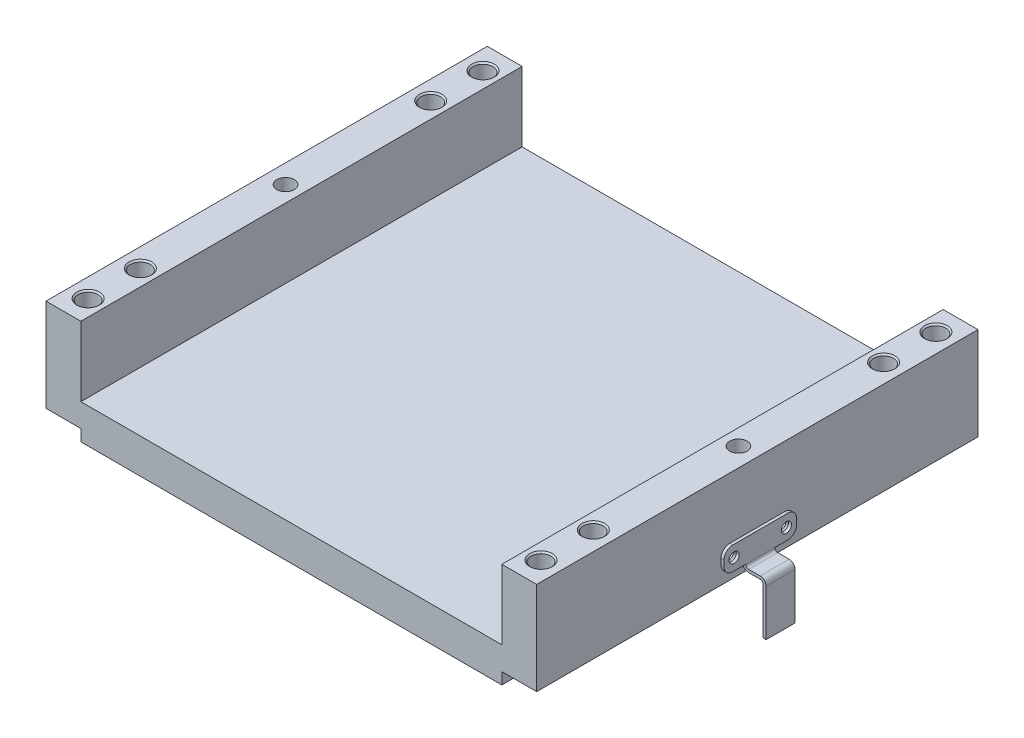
ISO-10303-21;
HEADER;
FILE_DESCRIPTION(('STEP AP214'),'2;1');
FILE_NAME('part.step','',(''),(''),'','','');
FILE_SCHEMA(('AUTOMOTIVE_DESIGN { 1 0 10303 214 1 1 1 1 }'));
ENDSEC;
DATA;
#1=APPLICATION_CONTEXT('core data for automotive mechanical design processes');
#2=APPLICATION_PROTOCOL_DEFINITION('international standard','automotive_design',2000,#1);
#3=PRODUCT_CONTEXT('',#1,'mechanical');
#4=PRODUCT('Part','Part','',(#3));
#5=PRODUCT_RELATED_PRODUCT_CATEGORY('part','',(#4));
#6=PRODUCT_DEFINITION_FORMATION('','',#4);
#7=PRODUCT_DEFINITION_CONTEXT('part definition',#1,'design');
#8=PRODUCT_DEFINITION('design','',#6,#7);
#9=PRODUCT_DEFINITION_SHAPE('','',#8);
#10=(LENGTH_UNIT() NAMED_UNIT(*) SI_UNIT(.MILLI.,.METRE.));
#11=(NAMED_UNIT(*) PLANE_ANGLE_UNIT() SI_UNIT($,.RADIAN.));
#12=(NAMED_UNIT(*) SI_UNIT($,.STERADIAN.) SOLID_ANGLE_UNIT());
#13=UNCERTAINTY_MEASURE_WITH_UNIT(LENGTH_MEASURE(1.E-05),#10,'distance_accuracy_value','');
#14=(GEOMETRIC_REPRESENTATION_CONTEXT(3) GLOBAL_UNCERTAINTY_ASSIGNED_CONTEXT((#13)) GLOBAL_UNIT_ASSIGNED_CONTEXT((#10,
#11,#12)) REPRESENTATION_CONTEXT('',''));
#15=CARTESIAN_POINT('',(0.,0.,0.));
#16=DIRECTION('',(0.,0.,1.));
#17=DIRECTION('',(1.,0.,0.));
#18=AXIS2_PLACEMENT_3D('',#15,#16,#17);
#19=CARTESIAN_POINT('',(77.5,22.,-9.));
#20=DIRECTION('',(1.,0.,0.));
#21=DIRECTION('',(0.,0.,-1.));
#22=AXIS2_PLACEMENT_3D('',#19,#20,#21);
#23=PLANE('',#22);
#24=CARTESIAN_POINT('',(77.5,22.,-9.));
#25=DIRECTION('',(-1.,0.,0.));
#26=DIRECTION('',(0.,0.,1.));
#27=AXIS2_PLACEMENT_3D('',#24,#25,#26);
#28=CIRCLE('',#27,1.25);
#29=CARTESIAN_POINT('',(77.5,22.,-7.75));
#30=VERTEX_POINT('',#29);
#31=EDGE_CURVE('E19',#30,#30,#28,.F.);
#32=ORIENTED_EDGE('',*,*,#31,.T.);
#33=EDGE_LOOP('',(#32));
#34=FACE_BOUND('',#33,.T.);
#35=ADVANCED_FACE('F16',(#34),#23,.T.);
#36=CARTESIAN_POINT('',(77.5,22.,9.));
#37=DIRECTION('',(1.,0.,0.));
#38=DIRECTION('',(0.,0.,-1.));
#39=AXIS2_PLACEMENT_3D('',#36,#37,#38);
#40=PLANE('',#39);
#41=CARTESIAN_POINT('',(77.5,22.,9.));
#42=DIRECTION('',(-1.,0.,0.));
#43=DIRECTION('',(0.,0.,1.));
#44=AXIS2_PLACEMENT_3D('',#41,#42,#43);
#45=CIRCLE('',#44,1.25);
#46=CARTESIAN_POINT('',(77.5,22.,10.25));
#47=VERTEX_POINT('',#46);
#48=EDGE_CURVE('E407',#47,#47,#45,.F.);
#49=ORIENTED_EDGE('',*,*,#48,.T.);
#50=EDGE_LOOP('',(#49));
#51=FACE_BOUND('',#50,.T.);
#52=ADVANCED_FACE('F561',(#51),#40,.T.);
#53=CARTESIAN_POINT('',(84.28583435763,22.,-9.));
#54=DIRECTION('',(-1.,0.,0.));
#55=DIRECTION('',(0.,0.,1.));
#56=AXIS2_PLACEMENT_3D('',#53,#54,#55);
#57=CYLINDRICAL_SURFACE('',#56,1.25);
#58=ORIENTED_EDGE('',*,*,#31,.F.);
#59=EDGE_LOOP('',(#58));
#60=FACE_BOUND('',#59,.T.);
#61=CARTESIAN_POINT('',(83.9999999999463,22.,-9.));
#62=DIRECTION('',(1.,0.,0.));
#63=DIRECTION('',(0.,0.,-1.));
#64=AXIS2_PLACEMENT_3D('',#61,#62,#63);
#65=CIRCLE('',#64,1.24999999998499);
#66=CARTESIAN_POINT('',(83.9999999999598,22.,-7.75000000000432));
#67=VERTEX_POINT('',#66);
#68=CARTESIAN_POINT('',(83.9999999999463,22.,-10.2499999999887));
#69=VERTEX_POINT('',#68);
#70=EDGE_CURVE('E397',#67,#69,#65,.T.);
#71=ORIENTED_EDGE('',*,*,#70,.T.);
#72=CARTESIAN_POINT('',(83.9999999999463,22.,-9.));
#73=DIRECTION('',(1.,0.,0.));
#74=DIRECTION('',(0.,0.,-1.));
#75=AXIS2_PLACEMENT_3D('',#72,#73,#74);
#76=CIRCLE('',#75,1.24999999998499);
#77=EDGE_CURVE('E396',#69,#67,#76,.T.);
#78=ORIENTED_EDGE('',*,*,#77,.T.);
#79=EDGE_LOOP('',(#71,#78));
#80=FACE_BOUND('',#79,.T.);
#81=ADVANCED_FACE('F557',(#60,#80),#57,.F.);
#82=CARTESIAN_POINT('',(84.28583435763,22.,9.));
#83=DIRECTION('',(-1.,0.,0.));
#84=DIRECTION('',(0.,0.,1.));
#85=AXIS2_PLACEMENT_3D('',#82,#83,#84);
#86=CYLINDRICAL_SURFACE('',#85,1.25);
#87=ORIENTED_EDGE('',*,*,#48,.F.);
#88=EDGE_LOOP('',(#87));
#89=FACE_BOUND('',#88,.T.);
#90=CARTESIAN_POINT('',(84.00000000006,22.,9.));
#91=DIRECTION('',(1.,0.,0.));
#92=DIRECTION('',(0.,0.,-1.));
#93=AXIS2_PLACEMENT_3D('',#90,#91,#92);
#94=CIRCLE('',#93,1.25000000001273);
#95=CARTESIAN_POINT('',(84.0000000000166,22.,10.2500000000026));
#96=VERTEX_POINT('',#95);
#97=CARTESIAN_POINT('',(84.0000000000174,22.,7.74999999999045));
#98=VERTEX_POINT('',#97);
#99=EDGE_CURVE('E380',#96,#98,#94,.T.);
#100=ORIENTED_EDGE('',*,*,#99,.T.);
#101=CARTESIAN_POINT('',(84.0000000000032,22.,9.));
#102=DIRECTION('',(1.,0.,0.));
#103=DIRECTION('',(0.,0.,-1.));
#104=AXIS2_PLACEMENT_3D('',#101,#102,#103);
#105=CIRCLE('',#104,1.25000000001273);
#106=EDGE_CURVE('E379',#98,#96,#105,.T.);
#107=ORIENTED_EDGE('',*,*,#106,.T.);
#108=EDGE_LOOP('',(#100,#107));
#109=FACE_BOUND('',#108,.T.);
#110=ADVANCED_FACE('F560',(#89,#109),#86,.F.);
#111=CARTESIAN_POINT('',(92.,-1.,0.));
#112=DIRECTION('',(0.,1.,0.));
#113=DIRECTION('',(0.,0.,1.));
#114=AXIS2_PLACEMENT_3D('',#111,#112,#113);
#115=PLANE('',#114);
#116=DIRECTION('',(1.,0.,0.));
#117=VECTOR('',#116,1.);
#118=CARTESIAN_POINT('',(92.,-1.,-5.));
#119=LINE('',#118,#117);
#120=CARTESIAN_POINT('',(92.5,-1.,-5.));
#121=VERTEX_POINT('',#120);
#122=CARTESIAN_POINT('',(91.5,-1.,-5.));
#123=VERTEX_POINT('',#122);
#124=EDGE_CURVE('E406',#121,#123,#119,.F.);
#125=ORIENTED_EDGE('',*,*,#124,.F.);
#126=DIRECTION('',(0.,0.,-1.));
#127=VECTOR('',#126,1.);
#128=CARTESIAN_POINT('',(92.5,-1.,0.));
#129=LINE('',#128,#127);
#130=CARTESIAN_POINT('',(92.5,-1.,5.));
#131=VERTEX_POINT('',#130);
#132=EDGE_CURVE('E356',#131,#121,#129,.T.);
#133=ORIENTED_EDGE('',*,*,#132,.F.);
#134=DIRECTION('',(1.,0.,0.));
#135=VECTOR('',#134,1.);
#136=CARTESIAN_POINT('',(92.,-1.,5.));
#137=LINE('',#136,#135);
#138=CARTESIAN_POINT('',(91.5,-1.,5.));
#139=VERTEX_POINT('',#138);
#140=EDGE_CURVE('E404',#139,#131,#137,.T.);
#141=ORIENTED_EDGE('',*,*,#140,.F.);
#142=DIRECTION('',(0.,0.,-1.));
#143=VECTOR('',#142,1.);
#144=CARTESIAN_POINT('',(91.5,-1.,0.));
#145=LINE('',#144,#143);
#146=EDGE_CURVE('E268',#139,#123,#145,.T.);
#147=ORIENTED_EDGE('',*,*,#146,.T.);
#148=EDGE_LOOP('',(#125,#133,#141,#147));
#149=FACE_BOUND('',#148,.T.);
#150=ADVANCED_FACE('F993',(#149),#115,.F.);
#151=CARTESIAN_POINT('',(84.4999999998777,22.,-9.));
#152=DIRECTION('',(1.,0.,0.));
#153=DIRECTION('',(0.,0.,-1.));
#154=AXIS2_PLACEMENT_3D('',#151,#152,#153);
#155=CONICAL_SURFACE('',#154,1.74999999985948,0.785398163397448);
#156=ORIENTED_EDGE('',*,*,#70,.F.);
#157=DIRECTION('',(-0.707106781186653,0.,-0.707106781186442));
#158=VECTOR('',#157,1.);
#159=CARTESIAN_POINT('',(499000.,22.0000000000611,498908.249999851));
#160=LINE('',#159,#158);
#161=CARTESIAN_POINT('',(84.5000000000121,22.,-7.24999999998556));
#162=VERTEX_POINT('',#161);
#163=EDGE_CURVE('E400',#67,#162,#160,.F.);
#164=ORIENTED_EDGE('',*,*,#163,.T.);
#165=CARTESIAN_POINT('',(84.5,22.,-9.));
#166=DIRECTION('',(-1.,0.,0.));
#167=DIRECTION('',(0.,0.,1.));
#168=AXIS2_PLACEMENT_3D('',#165,#166,#167);
#169=CIRCLE('',#168,1.75);
#170=CARTESIAN_POINT('',(84.5000000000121,22.,-10.7500000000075));
#171=VERTEX_POINT('',#170);
#172=EDGE_CURVE('E349',#162,#171,#169,.F.);
#173=ORIENTED_EDGE('',*,*,#172,.T.);
#174=DIRECTION('',(-0.707106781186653,0.,0.707106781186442));
#175=VECTOR('',#174,1.);
#176=CARTESIAN_POINT('',(499000.,22.,-498926.249999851));
#177=LINE('',#176,#175);
#178=EDGE_CURVE('E393',#171,#69,#177,.T.);
#179=ORIENTED_EDGE('',*,*,#178,.T.);
#180=EDGE_LOOP('',(#156,#164,#173,#179));
#181=FACE_BOUND('',#180,.T.);
#182=ADVANCED_FACE('F568',(#181),#155,.F.);
#183=CARTESIAN_POINT('',(84.5000000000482,22.,-9.));
#184=DIRECTION('',(1.,0.,0.));
#185=DIRECTION('',(0.,0.,-1.));
#186=AXIS2_PLACEMENT_3D('',#183,#184,#185);
#187=CONICAL_SURFACE('',#186,1.75000000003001,0.785398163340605);
#188=ORIENTED_EDGE('',*,*,#77,.F.);
#189=ORIENTED_EDGE('',*,*,#178,.F.);
#190=CARTESIAN_POINT('',(84.5,22.,-9.));
#191=DIRECTION('',(-1.,0.,0.));
#192=DIRECTION('',(0.,0.,1.));
#193=AXIS2_PLACEMENT_3D('',#190,#191,#192);
#194=CIRCLE('',#193,1.75);
#195=EDGE_CURVE('E368',#171,#162,#194,.F.);
#196=ORIENTED_EDGE('',*,*,#195,.T.);
#197=ORIENTED_EDGE('',*,*,#163,.F.);
#198=EDGE_LOOP('',(#188,#189,#196,#197));
#199=FACE_BOUND('',#198,.T.);
#200=ADVANCED_FACE('F572',(#199),#187,.F.);
#201=CARTESIAN_POINT('',(84.4999999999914,22.,9.));
#202=DIRECTION('',(1.,0.,0.));
#203=DIRECTION('',(0.,0.,-1.));
#204=AXIS2_PLACEMENT_3D('',#201,#202,#203);
#205=CONICAL_SURFACE('',#204,1.74999999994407,0.785398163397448);
#206=ORIENTED_EDGE('',*,*,#99,.F.);
#207=DIRECTION('',(-0.707106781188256,0.,-0.707106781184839));
#208=VECTOR('',#207,1.);
#209=CARTESIAN_POINT('',(499000.,22.0000000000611,498926.249997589));
#210=LINE('',#209,#208);
#211=CARTESIAN_POINT('',(84.5000000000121,22.,10.7499999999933));
#212=VERTEX_POINT('',#211);
#213=EDGE_CURVE('E259',#96,#212,#210,.F.);
#214=ORIENTED_EDGE('',*,*,#213,.T.);
#215=CARTESIAN_POINT('',(84.5,22.,9.));
#216=DIRECTION('',(-1.,0.,0.));
#217=DIRECTION('',(0.,0.,1.));
#218=AXIS2_PLACEMENT_3D('',#215,#216,#217);
#219=CIRCLE('',#218,1.75);
#220=CARTESIAN_POINT('',(84.5000000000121,22.,7.24999999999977));
#221=VERTEX_POINT('',#220);
#222=EDGE_CURVE('E365',#212,#221,#219,.F.);
#223=ORIENTED_EDGE('',*,*,#222,.T.);
#224=DIRECTION('',(-0.707106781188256,0.,0.707106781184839));
#225=VECTOR('',#224,1.);
#226=CARTESIAN_POINT('',(499000.,22.,-498908.249997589));
#227=LINE('',#226,#225);
#228=EDGE_CURVE('E376',#221,#98,#227,.T.);
#229=ORIENTED_EDGE('',*,*,#228,.T.);
#230=EDGE_LOOP('',(#206,#214,#223,#229));
#231=FACE_BOUND('',#230,.T.);
#232=ADVANCED_FACE('F1039',(#231),#205,.F.);
#233=CARTESIAN_POINT('',(84.5000000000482,22.,9.));
#234=DIRECTION('',(1.,0.,0.));
#235=DIRECTION('',(0.,0.,-1.));
#236=AXIS2_PLACEMENT_3D('',#233,#234,#235);
#237=CONICAL_SURFACE('',#236,1.75000000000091,0.785398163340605);
#238=ORIENTED_EDGE('',*,*,#106,.F.);
#239=ORIENTED_EDGE('',*,*,#228,.F.);
#240=CARTESIAN_POINT('',(84.5,22.,9.));
#241=DIRECTION('',(-1.,0.,0.));
#242=DIRECTION('',(0.,0.,1.));
#243=AXIS2_PLACEMENT_3D('',#240,#241,#242);
#244=CIRCLE('',#243,1.75);
#245=EDGE_CURVE('E367',#221,#212,#244,.F.);
#246=ORIENTED_EDGE('',*,*,#245,.T.);
#247=ORIENTED_EDGE('',*,*,#213,.F.);
#248=EDGE_LOOP('',(#238,#239,#246,#247));
#249=FACE_BOUND('',#248,.T.);
#250=ADVANCED_FACE('F1035',(#249),#237,.F.);
#251=CARTESIAN_POINT('',(-78.,27.,-68.));
#252=DIRECTION('',(0.,1.,0.));
#253=DIRECTION('',(0.,0.,1.));
#254=AXIS2_PLACEMENT_3D('',#251,#252,#253);
#255=PLANE('',#254);
#256=CARTESIAN_POINT('',(-78.,27.,-68.));
#257=DIRECTION('',(0.,1.,0.));
#258=DIRECTION('',(0.,0.,1.));
#259=AXIS2_PLACEMENT_3D('',#256,#257,#258);
#260=CIRCLE('',#259,3.4);
#261=CARTESIAN_POINT('',(-78.,27.,-64.6));
#262=VERTEX_POINT('',#261);
#263=EDGE_CURVE('E373',#262,#262,#260,.T.);
#264=ORIENTED_EDGE('',*,*,#263,.T.);
#265=EDGE_LOOP('',(#264));
#266=FACE_BOUND('',#265,.T.);
#267=ADVANCED_FACE('F1031',(#266),#255,.T.);
#268=CARTESIAN_POINT('',(-78.,27.,-50.));
#269=DIRECTION('',(0.,1.,0.));
#270=DIRECTION('',(0.,0.,1.));
#271=AXIS2_PLACEMENT_3D('',#268,#269,#270);
#272=PLANE('',#271);
#273=CARTESIAN_POINT('',(-78.,27.,-50.));
#274=DIRECTION('',(0.,1.,0.));
#275=DIRECTION('',(0.,0.,1.));
#276=AXIS2_PLACEMENT_3D('',#273,#274,#275);
#277=CIRCLE('',#276,3.4);
#278=CARTESIAN_POINT('',(-78.,27.,-46.6));
#279=VERTEX_POINT('',#278);
#280=EDGE_CURVE('E546',#279,#279,#277,.T.);
#281=ORIENTED_EDGE('',*,*,#280,.T.);
#282=EDGE_LOOP('',(#281));
#283=FACE_BOUND('',#282,.T.);
#284=ADVANCED_FACE('F1027',(#283),#272,.T.);
#285=CARTESIAN_POINT('',(-78.,27.,50.));
#286=DIRECTION('',(0.,1.,0.));
#287=DIRECTION('',(0.,0.,1.));
#288=AXIS2_PLACEMENT_3D('',#285,#286,#287);
#289=PLANE('',#288);
#290=CARTESIAN_POINT('',(-78.,27.,50.));
#291=DIRECTION('',(0.,1.,0.));
#292=DIRECTION('',(0.,0.,1.));
#293=AXIS2_PLACEMENT_3D('',#290,#291,#292);
#294=CIRCLE('',#293,3.4);
#295=CARTESIAN_POINT('',(-78.,27.,53.4));
#296=VERTEX_POINT('',#295);
#297=EDGE_CURVE('E543',#296,#296,#294,.T.);
#298=ORIENTED_EDGE('',*,*,#297,.T.);
#299=EDGE_LOOP('',(#298));
#300=FACE_BOUND('',#299,.T.);
#301=ADVANCED_FACE('F1023',(#300),#289,.T.);
#302=CARTESIAN_POINT('',(-78.,27.,68.));
#303=DIRECTION('',(0.,1.,0.));
#304=DIRECTION('',(0.,0.,1.));
#305=AXIS2_PLACEMENT_3D('',#302,#303,#304);
#306=PLANE('',#305);
#307=CARTESIAN_POINT('',(-78.,27.,68.));
#308=DIRECTION('',(0.,1.,0.));
#309=DIRECTION('',(0.,0.,1.));
#310=AXIS2_PLACEMENT_3D('',#307,#308,#309);
#311=CIRCLE('',#310,3.4);
#312=CARTESIAN_POINT('',(-78.,27.,71.4));
#313=VERTEX_POINT('',#312);
#314=EDGE_CURVE('E540',#313,#313,#311,.T.);
#315=ORIENTED_EDGE('',*,*,#314,.T.);
#316=EDGE_LOOP('',(#315));
#317=FACE_BOUND('',#316,.T.);
#318=ADVANCED_FACE('F1019',(#317),#306,.T.);
#319=CARTESIAN_POINT('',(-77.5,22.,-9.));
#320=DIRECTION('',(1.,0.,0.));
#321=DIRECTION('',(0.,0.,-1.));
#322=AXIS2_PLACEMENT_3D('',#319,#320,#321);
#323=PLANE('',#322);
#324=CARTESIAN_POINT('',(-77.5,22.,-9.));
#325=DIRECTION('',(-1.,0.,0.));
#326=DIRECTION('',(0.,0.,1.));
#327=AXIS2_PLACEMENT_3D('',#324,#325,#326);
#328=CIRCLE('',#327,1.25);
#329=CARTESIAN_POINT('',(-77.5,22.,-7.75));
#330=VERTEX_POINT('',#329);
#331=EDGE_CURVE('E537',#330,#330,#328,.T.);
#332=ORIENTED_EDGE('',*,*,#331,.T.);
#333=EDGE_LOOP('',(#332));
#334=FACE_BOUND('',#333,.T.);
#335=ADVANCED_FACE('F1015',(#334),#323,.F.);
#336=CARTESIAN_POINT('',(-77.5,22.,9.));
#337=DIRECTION('',(1.,0.,0.));
#338=DIRECTION('',(0.,0.,-1.));
#339=AXIS2_PLACEMENT_3D('',#336,#337,#338);
#340=PLANE('',#339);
#341=CARTESIAN_POINT('',(-77.5,22.,9.));
#342=DIRECTION('',(-1.,0.,0.));
#343=DIRECTION('',(0.,0.,1.));
#344=AXIS2_PLACEMENT_3D('',#341,#342,#343);
#345=CIRCLE('',#344,1.25);
#346=CARTESIAN_POINT('',(-77.5,22.,10.25));
#347=VERTEX_POINT('',#346);
#348=EDGE_CURVE('E534',#347,#347,#345,.T.);
#349=ORIENTED_EDGE('',*,*,#348,.T.);
#350=EDGE_LOOP('',(#349));
#351=FACE_BOUND('',#350,.T.);
#352=ADVANCED_FACE('F1012',(#351),#340,.F.);
#353=CARTESIAN_POINT('',(90.5,15.,5.285834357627));
#354=DIRECTION('',(0.,0.,-1.));
#355=DIRECTION('',(-1.,0.,0.));
#356=AXIS2_PLACEMENT_3D('',#353,#354,#355);
#357=CYLINDRICAL_SURFACE('',#356,1.);
#358=DIRECTION('',(0.,0.,-1.));
#359=VECTOR('',#358,1.);
#360=CARTESIAN_POINT('',(91.5,15.,0.));
#361=LINE('',#360,#359);
#362=CARTESIAN_POINT('',(91.5,15.,-5.));
#363=VERTEX_POINT('',#362);
#364=CARTESIAN_POINT('',(91.5,15.,5.));
#365=VERTEX_POINT('',#364);
#366=EDGE_CURVE('E258',#363,#365,#361,.F.);
#367=ORIENTED_EDGE('',*,*,#366,.T.);
#368=CARTESIAN_POINT('',(90.5,15.,5.));
#369=DIRECTION('',(0.,0.,-1.));
#370=DIRECTION('',(-1.,0.,0.));
#371=AXIS2_PLACEMENT_3D('',#368,#369,#370);
#372=CIRCLE('',#371,1.);
#373=CARTESIAN_POINT('',(90.5,16.,5.));
#374=VERTEX_POINT('',#373);
#375=EDGE_CURVE('E247',#374,#365,#372,.T.);
#376=ORIENTED_EDGE('',*,*,#375,.F.);
#377=DIRECTION('',(0.,0.,1.));
#378=VECTOR('',#377,1.);
#379=CARTESIAN_POINT('',(90.5,16.,0.));
#380=LINE('',#379,#378);
#381=CARTESIAN_POINT('',(90.5,16.,-5.));
#382=VERTEX_POINT('',#381);
#383=EDGE_CURVE('E291',#374,#382,#380,.F.);
#384=ORIENTED_EDGE('',*,*,#383,.T.);
#385=CARTESIAN_POINT('',(90.5,15.,-5.));
#386=DIRECTION('',(0.,0.,-1.));
#387=DIRECTION('',(-1.,0.,0.));
#388=AXIS2_PLACEMENT_3D('',#385,#386,#387);
#389=CIRCLE('',#388,1.);
#390=EDGE_CURVE('E264',#382,#363,#389,.T.);
#391=ORIENTED_EDGE('',*,*,#390,.T.);
#392=EDGE_LOOP('',(#367,#376,#384,#391));
#393=FACE_BOUND('',#392,.T.);
#394=ADVANCED_FACE('F262',(#393),#357,.F.);
#395=CARTESIAN_POINT('',(91.5,7.,0.));
#396=DIRECTION('',(1.,0.,0.));
#397=DIRECTION('',(0.,0.,-1.));
#398=AXIS2_PLACEMENT_3D('',#395,#396,#397);
#399=PLANE('',#398);
#400=ORIENTED_EDGE('',*,*,#146,.F.);
#401=DIRECTION('',(0.,1.,0.));
#402=VECTOR('',#401,1.);
#403=CARTESIAN_POINT('',(91.5,8.5,5.));
#404=LINE('',#403,#402);
#405=EDGE_CURVE('E255',#365,#139,#404,.F.);
#406=ORIENTED_EDGE('',*,*,#405,.F.);
#407=ORIENTED_EDGE('',*,*,#366,.F.);
#408=DIRECTION('',(0.,1.,0.));
#409=VECTOR('',#408,1.);
#410=CARTESIAN_POINT('',(91.5,8.5,-5.));
#411=LINE('',#410,#409);
#412=EDGE_CURVE('E298',#363,#123,#411,.F.);
#413=ORIENTED_EDGE('',*,*,#412,.T.);
#414=EDGE_LOOP('',(#400,#406,#407,#413));
#415=FACE_BOUND('',#414,.T.);
#416=ADVANCED_FACE('F271',(#415),#399,.F.);
#417=CARTESIAN_POINT('',(92.5,7.,0.));
#418=DIRECTION('',(1.,0.,0.));
#419=DIRECTION('',(0.,0.,-1.));
#420=AXIS2_PLACEMENT_3D('',#417,#418,#419);
#421=PLANE('',#420);
#422=DIRECTION('',(0.,1.,0.));
#423=VECTOR('',#422,1.);
#424=CARTESIAN_POINT('',(92.5,8.5,-5.));
#425=LINE('',#424,#423);
#426=CARTESIAN_POINT('',(92.5,15.,-5.));
#427=VERTEX_POINT('',#426);
#428=EDGE_CURVE('E296',#121,#427,#425,.T.);
#429=ORIENTED_EDGE('',*,*,#428,.T.);
#430=DIRECTION('',(0.,0.,1.));
#431=VECTOR('',#430,1.);
#432=CARTESIAN_POINT('',(92.5,15.,-5.285834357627));
#433=LINE('',#432,#431);
#434=CARTESIAN_POINT('',(92.5,15.,5.));
#435=VERTEX_POINT('',#434);
#436=EDGE_CURVE('E353',#435,#427,#433,.F.);
#437=ORIENTED_EDGE('',*,*,#436,.F.);
#438=DIRECTION('',(0.,1.,0.));
#439=VECTOR('',#438,1.);
#440=CARTESIAN_POINT('',(92.5,8.5,5.));
#441=LINE('',#440,#439);
#442=EDGE_CURVE('E273',#131,#435,#441,.T.);
#443=ORIENTED_EDGE('',*,*,#442,.F.);
#444=ORIENTED_EDGE('',*,*,#132,.T.);
#445=EDGE_LOOP('',(#429,#437,#443,#444));
#446=FACE_BOUND('',#445,.T.);
#447=ADVANCED_FACE('F996',(#446),#421,.T.);
#448=CARTESIAN_POINT('',(90.5,15.,-5.285834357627));
#449=DIRECTION('',(0.,0.,1.));
#450=DIRECTION('',(1.,0.,0.));
#451=AXIS2_PLACEMENT_3D('',#448,#449,#450);
#452=CYLINDRICAL_SURFACE('',#451,2.);
#453=DIRECTION('',(0.,0.,1.));
#454=VECTOR('',#453,1.);
#455=CARTESIAN_POINT('',(90.5,17.,0.));
#456=LINE('',#455,#454);
#457=CARTESIAN_POINT('',(90.5,17.,5.));
#458=VERTEX_POINT('',#457);
#459=CARTESIAN_POINT('',(90.5,17.,-5.));
#460=VERTEX_POINT('',#459);
#461=EDGE_CURVE('E350',#458,#460,#456,.F.);
#462=ORIENTED_EDGE('',*,*,#461,.F.);
#463=CARTESIAN_POINT('',(90.5,15.,5.));
#464=DIRECTION('',(0.,0.,1.));
#465=DIRECTION('',(1.,0.,0.));
#466=AXIS2_PLACEMENT_3D('',#463,#464,#465);
#467=CIRCLE('',#466,2.);
#468=EDGE_CURVE('E276',#435,#458,#467,.T.);
#469=ORIENTED_EDGE('',*,*,#468,.F.);
#470=ORIENTED_EDGE('',*,*,#436,.T.);
#471=CARTESIAN_POINT('',(90.5,15.,-5.));
#472=DIRECTION('',(0.,0.,1.));
#473=DIRECTION('',(1.,0.,0.));
#474=AXIS2_PLACEMENT_3D('',#471,#472,#473);
#475=CIRCLE('',#474,2.);
#476=EDGE_CURVE('E295',#427,#460,#475,.T.);
#477=ORIENTED_EDGE('',*,*,#476,.T.);
#478=EDGE_LOOP('',(#462,#469,#470,#477));
#479=FACE_BOUND('',#478,.T.);
#480=ADVANCED_FACE('F998',(#479),#452,.T.);
#481=CARTESIAN_POINT('',(88.5,17.,0.));
#482=DIRECTION('',(0.,1.,0.));
#483=DIRECTION('',(0.,0.,1.));
#484=AXIS2_PLACEMENT_3D('',#481,#482,#483);
#485=PLANE('',#484);
#486=DIRECTION('',(1.,0.,0.));
#487=VECTOR('',#486,1.);
#488=CARTESIAN_POINT('',(88.5,17.,-5.));
#489=LINE('',#488,#487);
#490=CARTESIAN_POINT('',(86.5,17.,-5.));
#491=VERTEX_POINT('',#490);
#492=EDGE_CURVE('E292',#460,#491,#489,.F.);
#493=ORIENTED_EDGE('',*,*,#492,.T.);
#494=DIRECTION('',(0.,0.,-1.));
#495=VECTOR('',#494,1.);
#496=CARTESIAN_POINT('',(86.5,17.,5.285834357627));
#497=LINE('',#496,#495);
#498=CARTESIAN_POINT('',(86.5,17.,5.));
#499=VERTEX_POINT('',#498);
#500=EDGE_CURVE('E347',#491,#499,#497,.F.);
#501=ORIENTED_EDGE('',*,*,#500,.T.);
#502=DIRECTION('',(1.,0.,0.));
#503=VECTOR('',#502,1.);
#504=CARTESIAN_POINT('',(88.5,17.,5.));
#505=LINE('',#504,#503);
#506=EDGE_CURVE('E528',#458,#499,#505,.F.);
#507=ORIENTED_EDGE('',*,*,#506,.F.);
#508=ORIENTED_EDGE('',*,*,#461,.T.);
#509=EDGE_LOOP('',(#493,#501,#507,#508));
#510=FACE_BOUND('',#509,.T.);
#511=ADVANCED_FACE('F588',(#510),#485,.T.);
#512=CARTESIAN_POINT('',(86.5,18.,5.285834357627));
#513=DIRECTION('',(0.,0.,-1.));
#514=DIRECTION('',(-1.,0.,0.));
#515=AXIS2_PLACEMENT_3D('',#512,#513,#514);
#516=CYLINDRICAL_SURFACE('',#515,1.);
#517=DIRECTION('',(0.,0.,-1.));
#518=VECTOR('',#517,1.);
#519=CARTESIAN_POINT('',(85.5,18.,0.));
#520=LINE('',#519,#518);
#521=CARTESIAN_POINT('',(85.5,18.,5.));
#522=VERTEX_POINT('',#521);
#523=CARTESIAN_POINT('',(85.5,18.,-5.));
#524=VERTEX_POINT('',#523);
#525=EDGE_CURVE('E524',#522,#524,#520,.T.);
#526=ORIENTED_EDGE('',*,*,#525,.F.);
#527=CARTESIAN_POINT('',(86.5,18.,5.));
#528=DIRECTION('',(0.,0.,-1.));
#529=DIRECTION('',(-1.,0.,0.));
#530=AXIS2_PLACEMENT_3D('',#527,#528,#529);
#531=CIRCLE('',#530,1.);
#532=EDGE_CURVE('E525',#499,#522,#531,.T.);
#533=ORIENTED_EDGE('',*,*,#532,.F.);
#534=ORIENTED_EDGE('',*,*,#500,.F.);
#535=CARTESIAN_POINT('',(86.5,18.,-5.));
#536=DIRECTION('',(0.,0.,-1.));
#537=DIRECTION('',(-1.,0.,0.));
#538=AXIS2_PLACEMENT_3D('',#535,#536,#537);
#539=CIRCLE('',#538,1.);
#540=EDGE_CURVE('E294',#491,#524,#539,.T.);
#541=ORIENTED_EDGE('',*,*,#540,.T.);
#542=EDGE_LOOP('',(#526,#533,#534,#541));
#543=FACE_BOUND('',#542,.T.);
#544=ADVANCED_FACE('F577',(#543),#516,.F.);
#545=CARTESIAN_POINT('',(85.78583435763,22.,-9.));
#546=DIRECTION('',(-1.,0.,0.));
#547=DIRECTION('',(0.,0.,1.));
#548=AXIS2_PLACEMENT_3D('',#545,#546,#547);
#549=CYLINDRICAL_SURFACE('',#548,1.75);
#550=CARTESIAN_POINT('',(85.5,22.,-9.));
#551=DIRECTION('',(-1.,0.,0.));
#552=DIRECTION('',(0.,0.,1.));
#553=AXIS2_PLACEMENT_3D('',#550,#551,#552);
#554=CIRCLE('',#553,1.75);
#555=CARTESIAN_POINT('',(85.5,22.,-7.25));
#556=VERTEX_POINT('',#555);
#557=EDGE_CURVE('E521',#556,#556,#554,.T.);
#558=ORIENTED_EDGE('',*,*,#557,.F.);
#559=EDGE_LOOP('',(#558));
#560=FACE_BOUND('',#559,.T.);
#561=ORIENTED_EDGE('',*,*,#172,.F.);
#562=ORIENTED_EDGE('',*,*,#195,.F.);
#563=EDGE_LOOP('',(#561,#562));
#564=FACE_BOUND('',#563,.T.);
#565=ADVANCED_FACE('F574',(#560,#564),#549,.F.);
#566=CARTESIAN_POINT('',(85.78583435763,22.,9.));
#567=DIRECTION('',(-1.,0.,0.));
#568=DIRECTION('',(0.,0.,1.));
#569=AXIS2_PLACEMENT_3D('',#566,#567,#568);
#570=CYLINDRICAL_SURFACE('',#569,1.75);
#571=CARTESIAN_POINT('',(85.5,22.,9.));
#572=DIRECTION('',(-1.,0.,0.));
#573=DIRECTION('',(0.,0.,1.));
#574=AXIS2_PLACEMENT_3D('',#571,#572,#573);
#575=CIRCLE('',#574,1.75);
#576=CARTESIAN_POINT('',(85.5,22.,10.75));
#577=VERTEX_POINT('',#576);
#578=EDGE_CURVE('E518',#577,#577,#575,.T.);
#579=ORIENTED_EDGE('',*,*,#578,.F.);
#580=EDGE_LOOP('',(#579));
#581=FACE_BOUND('',#580,.T.);
#582=ORIENTED_EDGE('',*,*,#222,.F.);
#583=ORIENTED_EDGE('',*,*,#245,.F.);
#584=EDGE_LOOP('',(#582,#583));
#585=FACE_BOUND('',#584,.T.);
#586=ADVANCED_FACE('F576',(#581,#585),#570,.F.);
#587=CARTESIAN_POINT('',(78.,27.,-68.));
#588=DIRECTION('',(0.,1.,0.));
#589=DIRECTION('',(0.,0.,1.));
#590=AXIS2_PLACEMENT_3D('',#587,#588,#589);
#591=PLANE('',#590);
#592=CARTESIAN_POINT('',(78.,27.,-68.));
#593=DIRECTION('',(0.,1.,0.));
#594=DIRECTION('',(0.,0.,1.));
#595=AXIS2_PLACEMENT_3D('',#592,#593,#594);
#596=CIRCLE('',#595,3.4);
#597=CARTESIAN_POINT('',(78.,27.,-64.6));
#598=VERTEX_POINT('',#597);
#599=EDGE_CURVE('E515',#598,#598,#596,.T.);
#600=ORIENTED_EDGE('',*,*,#599,.T.);
#601=EDGE_LOOP('',(#600));
#602=FACE_BOUND('',#601,.T.);
#603=ADVANCED_FACE('F585',(#602),#591,.T.);
#604=CARTESIAN_POINT('',(78.,27.,-50.));
#605=DIRECTION('',(0.,1.,0.));
#606=DIRECTION('',(0.,0.,1.));
#607=AXIS2_PLACEMENT_3D('',#604,#605,#606);
#608=PLANE('',#607);
#609=CARTESIAN_POINT('',(78.,27.,-50.));
#610=DIRECTION('',(0.,1.,0.));
#611=DIRECTION('',(0.,0.,1.));
#612=AXIS2_PLACEMENT_3D('',#609,#610,#611);
#613=CIRCLE('',#612,3.4);
#614=CARTESIAN_POINT('',(78.,27.,-46.6));
#615=VERTEX_POINT('',#614);
#616=EDGE_CURVE('E512',#615,#615,#613,.T.);
#617=ORIENTED_EDGE('',*,*,#616,.T.);
#618=EDGE_LOOP('',(#617));
#619=FACE_BOUND('',#618,.T.);
#620=ADVANCED_FACE('F812',(#619),#608,.T.);
#621=CARTESIAN_POINT('',(78.,27.,50.));
#622=DIRECTION('',(0.,1.,0.));
#623=DIRECTION('',(0.,0.,1.));
#624=AXIS2_PLACEMENT_3D('',#621,#622,#623);
#625=PLANE('',#624);
#626=CARTESIAN_POINT('',(78.,27.,50.));
#627=DIRECTION('',(0.,1.,0.));
#628=DIRECTION('',(0.,0.,1.));
#629=AXIS2_PLACEMENT_3D('',#626,#627,#628);
#630=CIRCLE('',#629,3.4);
#631=CARTESIAN_POINT('',(78.,27.,53.4));
#632=VERTEX_POINT('',#631);
#633=EDGE_CURVE('E509',#632,#632,#630,.T.);
#634=ORIENTED_EDGE('',*,*,#633,.T.);
#635=EDGE_LOOP('',(#634));
#636=FACE_BOUND('',#635,.T.);
#637=ADVANCED_FACE('F808',(#636),#625,.T.);
#638=CARTESIAN_POINT('',(78.,27.,68.));
#639=DIRECTION('',(0.,1.,0.));
#640=DIRECTION('',(0.,0.,1.));
#641=AXIS2_PLACEMENT_3D('',#638,#639,#640);
#642=PLANE('',#641);
#643=CARTESIAN_POINT('',(78.,27.,68.));
#644=DIRECTION('',(0.,1.,0.));
#645=DIRECTION('',(0.,0.,1.));
#646=AXIS2_PLACEMENT_3D('',#643,#644,#645);
#647=CIRCLE('',#646,3.4);
#648=CARTESIAN_POINT('',(78.,27.,71.4));
#649=VERTEX_POINT('',#648);
#650=EDGE_CURVE('E506',#649,#649,#647,.T.);
#651=ORIENTED_EDGE('',*,*,#650,.T.);
#652=EDGE_LOOP('',(#651));
#653=FACE_BOUND('',#652,.T.);
#654=ADVANCED_FACE('F804',(#653),#642,.T.);
#655=CARTESIAN_POINT('',(-78.,32.,4.396602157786E-06));
#656=DIRECTION('',(0.,1.,0.));
#657=DIRECTION('',(0.,0.,1.));
#658=AXIS2_PLACEMENT_3D('',#655,#656,#657);
#659=PLANE('',#658);
#660=CARTESIAN_POINT('',(-78.,32.,0.));
#661=DIRECTION('',(0.,1.,0.));
#662=DIRECTION('',(0.,0.,1.));
#663=AXIS2_PLACEMENT_3D('',#660,#661,#662);
#664=CIRCLE('',#663,3.);
#665=CARTESIAN_POINT('',(-78.,32.,3.));
#666=VERTEX_POINT('',#665);
#667=EDGE_CURVE('E346',#666,#666,#664,.T.);
#668=ORIENTED_EDGE('',*,*,#667,.T.);
#669=EDGE_LOOP('',(#668));
#670=FACE_BOUND('',#669,.T.);
#671=ADVANCED_FACE('F800',(#670),#659,.T.);
#672=CARTESIAN_POINT('',(-78.,26.61,-68.));
#673=DIRECTION('',(0.,1.,0.));
#674=DIRECTION('',(0.,0.,1.));
#675=AXIS2_PLACEMENT_3D('',#672,#673,#674);
#676=CYLINDRICAL_SURFACE('',#675,3.4);
#677=ORIENTED_EDGE('',*,*,#263,.F.);
#678=EDGE_LOOP('',(#677));
#679=FACE_BOUND('',#678,.T.);
#680=CARTESIAN_POINT('',(-78.,46.4999999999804,-68.));
#681=DIRECTION('',(0.,1.,0.));
#682=DIRECTION('',(0.,0.,-1.));
#683=AXIS2_PLACEMENT_3D('',#680,#681,#682);
#684=CIRCLE('',#683,3.39999999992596);
#685=CARTESIAN_POINT('',(-78.,46.4999999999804,-71.399999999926));
#686=VERTEX_POINT('',#685);
#687=EDGE_CURVE('E343',#686,#686,#684,.T.);
#688=ORIENTED_EDGE('',*,*,#687,.T.);
#689=EDGE_LOOP('',(#688));
#690=FACE_BOUND('',#689,.T.);
#691=ADVANCED_FACE('F796',(#679,#690),#676,.F.);
#692=CARTESIAN_POINT('',(-78.,26.61,-50.));
#693=DIRECTION('',(0.,1.,0.));
#694=DIRECTION('',(0.,0.,1.));
#695=AXIS2_PLACEMENT_3D('',#692,#693,#694);
#696=CYLINDRICAL_SURFACE('',#695,3.4);
#697=ORIENTED_EDGE('',*,*,#280,.F.);
#698=EDGE_LOOP('',(#697));
#699=FACE_BOUND('',#698,.T.);
#700=CARTESIAN_POINT('',(-78.,46.4999999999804,-50.));
#701=DIRECTION('',(0.,1.,0.));
#702=DIRECTION('',(0.,0.,-1.));
#703=AXIS2_PLACEMENT_3D('',#700,#701,#702);
#704=CIRCLE('',#703,3.3999999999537);
#705=CARTESIAN_POINT('',(-78.,46.4999999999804,-53.3999999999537));
#706=VERTEX_POINT('',#705);
#707=EDGE_CURVE('E340',#706,#706,#704,.T.);
#708=ORIENTED_EDGE('',*,*,#707,.T.);
#709=EDGE_LOOP('',(#708));
#710=FACE_BOUND('',#709,.T.);
#711=ADVANCED_FACE('F792',(#699,#710),#696,.F.);
#712=CARTESIAN_POINT('',(-78.,26.61,50.));
#713=DIRECTION('',(0.,1.,0.));
#714=DIRECTION('',(0.,0.,1.));
#715=AXIS2_PLACEMENT_3D('',#712,#713,#714);
#716=CYLINDRICAL_SURFACE('',#715,3.4);
#717=ORIENTED_EDGE('',*,*,#297,.F.);
#718=EDGE_LOOP('',(#717));
#719=FACE_BOUND('',#718,.T.);
#720=CARTESIAN_POINT('',(-78.,46.5000000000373,50.));
#721=DIRECTION('',(0.,1.,0.));
#722=DIRECTION('',(0.,0.,-1.));
#723=AXIS2_PLACEMENT_3D('',#720,#721,#722);
#724=CIRCLE('',#723,3.39999999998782);
#725=CARTESIAN_POINT('',(-78.,46.5000000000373,46.6000000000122));
#726=VERTEX_POINT('',#725);
#727=EDGE_CURVE('E337',#726,#726,#724,.T.);
#728=ORIENTED_EDGE('',*,*,#727,.T.);
#729=EDGE_LOOP('',(#728));
#730=FACE_BOUND('',#729,.T.);
#731=ADVANCED_FACE('F788',(#719,#730),#716,.F.);
#732=CARTESIAN_POINT('',(-78.,26.61,68.));
#733=DIRECTION('',(0.,1.,0.));
#734=DIRECTION('',(0.,0.,1.));
#735=AXIS2_PLACEMENT_3D('',#732,#733,#734);
#736=CYLINDRICAL_SURFACE('',#735,3.4);
#737=ORIENTED_EDGE('',*,*,#314,.F.);
#738=EDGE_LOOP('',(#737));
#739=FACE_BOUND('',#738,.T.);
#740=CARTESIAN_POINT('',(-78.,46.5000000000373,68.));
#741=DIRECTION('',(0.,1.,0.));
#742=DIRECTION('',(0.,0.,-1.));
#743=AXIS2_PLACEMENT_3D('',#740,#741,#742);
#744=CIRCLE('',#743,3.40000000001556);
#745=CARTESIAN_POINT('',(-78.,46.5000000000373,64.5999999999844));
#746=VERTEX_POINT('',#745);
#747=EDGE_CURVE('E328',#746,#746,#744,.T.);
#748=ORIENTED_EDGE('',*,*,#747,.T.);
#749=EDGE_LOOP('',(#748));
#750=FACE_BOUND('',#749,.T.);
#751=ADVANCED_FACE('F784',(#739,#750),#736,.F.);
#752=CARTESIAN_POINT('',(-77.21416564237,22.,-9.));
#753=DIRECTION('',(-1.,0.,0.));
#754=DIRECTION('',(0.,0.,1.));
#755=AXIS2_PLACEMENT_3D('',#752,#753,#754);
#756=CYLINDRICAL_SURFACE('',#755,1.25);
#757=ORIENTED_EDGE('',*,*,#331,.F.);
#758=EDGE_LOOP('',(#757));
#759=FACE_BOUND('',#758,.T.);
#760=CARTESIAN_POINT('',(-83.9999999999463,22.,-9.));
#761=DIRECTION('',(-1.,0.,0.));
#762=DIRECTION('',(0.,0.,-1.));
#763=AXIS2_PLACEMENT_3D('',#760,#761,#762);
#764=CIRCLE('',#763,1.24999999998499);
#765=CARTESIAN_POINT('',(-83.9999999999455,22.,-10.2499999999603));
#766=VERTEX_POINT('',#765);
#767=CARTESIAN_POINT('',(-83.999999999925,22.,-7.75000000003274));
#768=VERTEX_POINT('',#767);
#769=EDGE_CURVE('E325',#766,#768,#764,.T.);
#770=ORIENTED_EDGE('',*,*,#769,.T.);
#771=CARTESIAN_POINT('',(-83.9999999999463,22.,-9.));
#772=DIRECTION('',(-1.,0.,0.));
#773=DIRECTION('',(0.,0.,-1.));
#774=AXIS2_PLACEMENT_3D('',#771,#772,#773);
#775=CIRCLE('',#774,1.24999999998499);
#776=EDGE_CURVE('E331',#768,#766,#775,.T.);
#777=ORIENTED_EDGE('',*,*,#776,.T.);
#778=EDGE_LOOP('',(#770,#777));
#779=FACE_BOUND('',#778,.T.);
#780=ADVANCED_FACE('F780',(#759,#779),#756,.F.);
#781=CARTESIAN_POINT('',(-77.21416564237,22.,9.));
#782=DIRECTION('',(-1.,0.,0.));
#783=DIRECTION('',(0.,0.,1.));
#784=AXIS2_PLACEMENT_3D('',#781,#782,#783);
#785=CYLINDRICAL_SURFACE('',#784,1.25);
#786=ORIENTED_EDGE('',*,*,#348,.F.);
#787=EDGE_LOOP('',(#786));
#788=FACE_BOUND('',#787,.T.);
#789=CARTESIAN_POINT('',(-84.0000000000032,22.,9.));
#790=DIRECTION('',(-1.,0.,0.));
#791=DIRECTION('',(0.,0.,-1.));
#792=AXIS2_PLACEMENT_3D('',#789,#790,#791);
#793=CIRCLE('',#792,1.25000000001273);
#794=CARTESIAN_POINT('',(-84.0000000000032,22.,7.74999999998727));
#795=VERTEX_POINT('',#794);
#796=EDGE_CURVE('E320',#795,#795,#793,.T.);
#797=ORIENTED_EDGE('',*,*,#796,.T.);
#798=EDGE_LOOP('',(#797));
#799=FACE_BOUND('',#798,.T.);
#800=ADVANCED_FACE('F776',(#788,#799),#785,.F.);
#801=CARTESIAN_POINT('',(88.5,8.5,-5.));
#802=DIRECTION('',(0.,0.,1.));
#803=DIRECTION('',(1.,0.,0.));
#804=AXIS2_PLACEMENT_3D('',#801,#802,#803);
#805=PLANE('',#804);
#806=ORIENTED_EDGE('',*,*,#492,.F.);
#807=ORIENTED_EDGE('',*,*,#476,.F.);
#808=ORIENTED_EDGE('',*,*,#428,.F.);
#809=ORIENTED_EDGE('',*,*,#124,.T.);
#810=ORIENTED_EDGE('',*,*,#412,.F.);
#811=ORIENTED_EDGE('',*,*,#390,.F.);
#812=DIRECTION('',(1.,0.,0.));
#813=VECTOR('',#812,1.);
#814=CARTESIAN_POINT('',(88.5,16.,-5.));
#815=LINE('',#814,#813);
#816=CARTESIAN_POINT('',(86.5,16.,-5.));
#817=VERTEX_POINT('',#816);
#818=EDGE_CURVE('E278',#382,#817,#815,.F.);
#819=ORIENTED_EDGE('',*,*,#818,.T.);
#820=CARTESIAN_POINT('',(86.5,18.,-5.));
#821=DIRECTION('',(0.,0.,1.));
#822=DIRECTION('',(1.,0.,0.));
#823=AXIS2_PLACEMENT_3D('',#820,#821,#822);
#824=CIRCLE('',#823,2.);
#825=CARTESIAN_POINT('',(84.5,18.,-5.));
#826=VERTEX_POINT('',#825);
#827=EDGE_CURVE('E289',#826,#817,#824,.T.);
#828=ORIENTED_EDGE('',*,*,#827,.F.);
#829=DIRECTION('',(1.,0.,0.));
#830=VECTOR('',#829,1.);
#831=CARTESIAN_POINT('',(85.,18.,-5.));
#832=LINE('',#831,#830);
#833=EDGE_CURVE('E307',#826,#524,#832,.T.);
#834=ORIENTED_EDGE('',*,*,#833,.T.);
#835=ORIENTED_EDGE('',*,*,#540,.F.);
#836=EDGE_LOOP('',(#806,#807,#808,#809,#810,#811,#819,#828,#834,#835));
#837=FACE_BOUND('',#836,.T.);
#838=ADVANCED_FACE('F772',(#837),#805,.F.);
#839=CARTESIAN_POINT('',(88.5,16.,0.));
#840=DIRECTION('',(0.,1.,0.));
#841=DIRECTION('',(0.,0.,1.));
#842=AXIS2_PLACEMENT_3D('',#839,#840,#841);
#843=PLANE('',#842);
#844=ORIENTED_EDGE('',*,*,#383,.F.);
#845=DIRECTION('',(1.,0.,0.));
#846=VECTOR('',#845,1.);
#847=CARTESIAN_POINT('',(88.5,16.,5.));
#848=LINE('',#847,#846);
#849=CARTESIAN_POINT('',(86.5,16.,5.));
#850=VERTEX_POINT('',#849);
#851=EDGE_CURVE('E257',#850,#374,#848,.T.);
#852=ORIENTED_EDGE('',*,*,#851,.F.);
#853=DIRECTION('',(0.,0.,1.));
#854=VECTOR('',#853,1.);
#855=CARTESIAN_POINT('',(86.5,16.,-5.285834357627));
#856=LINE('',#855,#854);
#857=EDGE_CURVE('E285',#817,#850,#856,.T.);
#858=ORIENTED_EDGE('',*,*,#857,.F.);
#859=ORIENTED_EDGE('',*,*,#818,.F.);
#860=EDGE_LOOP('',(#844,#852,#858,#859));
#861=FACE_BOUND('',#860,.T.);
#862=ADVANCED_FACE('F769',(#861),#843,.F.);
#863=CARTESIAN_POINT('',(88.5,8.5,5.));
#864=DIRECTION('',(0.,0.,1.));
#865=DIRECTION('',(1.,0.,0.));
#866=AXIS2_PLACEMENT_3D('',#863,#864,#865);
#867=PLANE('',#866);
#868=ORIENTED_EDGE('',*,*,#532,.T.);
#869=DIRECTION('',(1.,0.,0.));
#870=VECTOR('',#869,1.);
#871=CARTESIAN_POINT('',(88.5,18.,5.));
#872=LINE('',#871,#870);
#873=CARTESIAN_POINT('',(84.5,18.,5.));
#874=VERTEX_POINT('',#873);
#875=EDGE_CURVE('E527',#522,#874,#872,.F.);
#876=ORIENTED_EDGE('',*,*,#875,.T.);
#877=CARTESIAN_POINT('',(86.5,18.,5.));
#878=DIRECTION('',(0.,0.,1.));
#879=DIRECTION('',(1.,0.,0.));
#880=AXIS2_PLACEMENT_3D('',#877,#878,#879);
#881=CIRCLE('',#880,2.);
#882=EDGE_CURVE('E288',#850,#874,#881,.F.);
#883=ORIENTED_EDGE('',*,*,#882,.F.);
#884=ORIENTED_EDGE('',*,*,#851,.T.);
#885=ORIENTED_EDGE('',*,*,#375,.T.);
#886=ORIENTED_EDGE('',*,*,#405,.T.);
#887=ORIENTED_EDGE('',*,*,#140,.T.);
#888=ORIENTED_EDGE('',*,*,#442,.T.);
#889=ORIENTED_EDGE('',*,*,#468,.T.);
#890=ORIENTED_EDGE('',*,*,#506,.T.);
#891=EDGE_LOOP('',(#868,#876,#883,#884,#885,#886,#887,#888,#889,#890));
#892=FACE_BOUND('',#891,.T.);
#893=ADVANCED_FACE('F253',(#892),#867,.T.);
#894=CARTESIAN_POINT('',(85.5,22.,0.));
#895=DIRECTION('',(1.,0.,0.));
#896=DIRECTION('',(0.,0.,-1.));
#897=AXIS2_PLACEMENT_3D('',#894,#895,#896);
#898=PLANE('',#897);
#899=ORIENTED_EDGE('',*,*,#578,.T.);
#900=EDGE_LOOP('',(#899));
#901=FACE_BOUND('',#900,.T.);
#902=ORIENTED_EDGE('',*,*,#557,.T.);
#903=EDGE_LOOP('',(#902));
#904=FACE_BOUND('',#903,.T.);
#905=DIRECTION('',(0.,1.,0.));
#906=VECTOR('',#905,1.);
#907=CARTESIAN_POINT('',(85.5,22.,12.5));
#908=LINE('',#907,#906);
#909=CARTESIAN_POINT('',(85.5,21.,12.5));
#910=VERTEX_POINT('',#909);
#911=CARTESIAN_POINT('',(85.5,23.,12.5));
#912=VERTEX_POINT('',#911);
#913=EDGE_CURVE('E316',#910,#912,#908,.T.);
#914=ORIENTED_EDGE('',*,*,#913,.F.);
#915=CARTESIAN_POINT('',(85.5,21.,9.5));
#916=DIRECTION('',(1.,0.,0.));
#917=DIRECTION('',(0.,0.,-1.));
#918=AXIS2_PLACEMENT_3D('',#915,#916,#917);
#919=CIRCLE('',#918,3.);
#920=CARTESIAN_POINT('',(85.5,18.,9.5));
#921=VERTEX_POINT('',#920);
#922=EDGE_CURVE('E323',#921,#910,#919,.F.);
#923=ORIENTED_EDGE('',*,*,#922,.F.);
#924=DIRECTION('',(0.,0.,1.));
#925=VECTOR('',#924,1.);
#926=CARTESIAN_POINT('',(85.5,18.,7.25));
#927=LINE('',#926,#925);
#928=EDGE_CURVE('E489',#921,#522,#927,.F.);
#929=ORIENTED_EDGE('',*,*,#928,.T.);
#930=ORIENTED_EDGE('',*,*,#525,.T.);
#931=DIRECTION('',(0.,0.,1.));
#932=VECTOR('',#931,1.);
#933=CARTESIAN_POINT('',(85.5,18.,-7.25));
#934=LINE('',#933,#932);
#935=CARTESIAN_POINT('',(85.5,18.,-9.5));
#936=VERTEX_POINT('',#935);
#937=EDGE_CURVE('E304',#524,#936,#934,.F.);
#938=ORIENTED_EDGE('',*,*,#937,.T.);
#939=CARTESIAN_POINT('',(85.5,21.,-9.5));
#940=DIRECTION('',(1.,0.,0.));
#941=DIRECTION('',(0.,0.,-1.));
#942=AXIS2_PLACEMENT_3D('',#939,#940,#941);
#943=CIRCLE('',#942,3.);
#944=CARTESIAN_POINT('',(85.5,21.,-12.5));
#945=VERTEX_POINT('',#944);
#946=EDGE_CURVE('E495',#945,#936,#943,.F.);
#947=ORIENTED_EDGE('',*,*,#946,.F.);
#948=DIRECTION('',(0.,1.,0.));
#949=VECTOR('',#948,1.);
#950=CARTESIAN_POINT('',(85.5,22.,-12.5));
#951=LINE('',#950,#949);
#952=CARTESIAN_POINT('',(85.5,23.,-12.5));
#953=VERTEX_POINT('',#952);
#954=EDGE_CURVE('E308',#945,#953,#951,.T.);
#955=ORIENTED_EDGE('',*,*,#954,.T.);
#956=CARTESIAN_POINT('',(85.5,23.,-9.5));
#957=DIRECTION('',(1.,0.,0.));
#958=DIRECTION('',(0.,0.,-1.));
#959=AXIS2_PLACEMENT_3D('',#956,#957,#958);
#960=CIRCLE('',#959,3.);
#961=CARTESIAN_POINT('',(85.5,26.,-9.5));
#962=VERTEX_POINT('',#961);
#963=EDGE_CURVE('E311',#962,#953,#960,.F.);
#964=ORIENTED_EDGE('',*,*,#963,.F.);
#965=DIRECTION('',(0.,0.,1.));
#966=VECTOR('',#965,1.);
#967=CARTESIAN_POINT('',(85.5,26.,0.));
#968=LINE('',#967,#966);
#969=CARTESIAN_POINT('',(85.5,26.,9.5));
#970=VERTEX_POINT('',#969);
#971=EDGE_CURVE('E312',#970,#962,#968,.F.);
#972=ORIENTED_EDGE('',*,*,#971,.F.);
#973=CARTESIAN_POINT('',(85.5,23.,9.5));
#974=DIRECTION('',(1.,0.,0.));
#975=DIRECTION('',(0.,0.,-1.));
#976=AXIS2_PLACEMENT_3D('',#973,#974,#975);
#977=CIRCLE('',#976,3.);
#978=EDGE_CURVE('E501',#912,#970,#977,.F.);
#979=ORIENTED_EDGE('',*,*,#978,.F.);
#980=EDGE_LOOP('',(#914,#923,#929,#930,#938,#947,#955,#964,#972,#979));
#981=FACE_BOUND('',#980,.T.);
#982=ADVANCED_FACE('F762',(#901,#904,#981),#898,.T.);
#983=CARTESIAN_POINT('',(78.,32.,0.));
#984=DIRECTION('',(0.,1.,0.));
#985=DIRECTION('',(0.,0.,1.));
#986=AXIS2_PLACEMENT_3D('',#983,#984,#985);
#987=PLANE('',#986);
#988=CARTESIAN_POINT('',(78.,32.,0.));
#989=DIRECTION('',(0.,1.,0.));
#990=DIRECTION('',(0.,0.,1.));
#991=AXIS2_PLACEMENT_3D('',#988,#989,#990);
#992=CIRCLE('',#991,3.);
#993=CARTESIAN_POINT('',(78.,32.,3.));
#994=VERTEX_POINT('',#993);
#995=EDGE_CURVE('E485',#994,#994,#992,.T.);
#996=ORIENTED_EDGE('',*,*,#995,.T.);
#997=EDGE_LOOP('',(#996));
#998=FACE_BOUND('',#997,.T.);
#999=ADVANCED_FACE('F758',(#998),#987,.T.);
#1000=CARTESIAN_POINT('',(78.,26.61,-68.));
#1001=DIRECTION('',(0.,1.,0.));
#1002=DIRECTION('',(0.,0.,1.));
#1003=AXIS2_PLACEMENT_3D('',#1000,#1001,#1002);
#1004=CYLINDRICAL_SURFACE('',#1003,3.4);
#1005=ORIENTED_EDGE('',*,*,#599,.F.);
#1006=EDGE_LOOP('',(#1005));
#1007=FACE_BOUND('',#1006,.T.);
#1008=CARTESIAN_POINT('',(78.,46.4999999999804,-68.));
#1009=DIRECTION('',(0.,1.,0.));
#1010=DIRECTION('',(0.,0.,-1.));
#1011=AXIS2_PLACEMENT_3D('',#1008,#1009,#1010);
#1012=CIRCLE('',#1011,3.39999999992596);
#1013=CARTESIAN_POINT('',(78.,46.4999999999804,-71.399999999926));
#1014=VERTEX_POINT('',#1013);
#1015=EDGE_CURVE('E488',#1014,#1014,#1012,.T.);
#1016=ORIENTED_EDGE('',*,*,#1015,.T.);
#1017=EDGE_LOOP('',(#1016));
#1018=FACE_BOUND('',#1017,.T.);
#1019=ADVANCED_FACE('F754',(#1007,#1018),#1004,.F.);
#1020=CARTESIAN_POINT('',(78.,26.61,-50.));
#1021=DIRECTION('',(0.,1.,0.));
#1022=DIRECTION('',(0.,0.,1.));
#1023=AXIS2_PLACEMENT_3D('',#1020,#1021,#1022);
#1024=CYLINDRICAL_SURFACE('',#1023,3.4);
#1025=ORIENTED_EDGE('',*,*,#616,.F.);
#1026=EDGE_LOOP('',(#1025));
#1027=FACE_BOUND('',#1026,.T.);
#1028=CARTESIAN_POINT('',(78.,46.4999999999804,-50.));
#1029=DIRECTION('',(0.,1.,0.));
#1030=DIRECTION('',(0.,0.,-1.));
#1031=AXIS2_PLACEMENT_3D('',#1028,#1029,#1030);
#1032=CIRCLE('',#1031,3.3999999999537);
#1033=CARTESIAN_POINT('',(78.,46.4999999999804,-53.3999999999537));
#1034=VERTEX_POINT('',#1033);
#1035=EDGE_CURVE('E825',#1034,#1034,#1032,.T.);
#1036=ORIENTED_EDGE('',*,*,#1035,.T.);
#1037=EDGE_LOOP('',(#1036));
#1038=FACE_BOUND('',#1037,.T.);
#1039=ADVANCED_FACE('F750',(#1027,#1038),#1024,.F.);
#1040=CARTESIAN_POINT('',(78.,26.61,50.));
#1041=DIRECTION('',(0.,1.,0.));
#1042=DIRECTION('',(0.,0.,1.));
#1043=AXIS2_PLACEMENT_3D('',#1040,#1041,#1042);
#1044=CYLINDRICAL_SURFACE('',#1043,3.4);
#1045=ORIENTED_EDGE('',*,*,#633,.F.);
#1046=EDGE_LOOP('',(#1045));
#1047=FACE_BOUND('',#1046,.T.);
#1048=CARTESIAN_POINT('',(78.,46.5000000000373,50.));
#1049=DIRECTION('',(0.,1.,0.));
#1050=DIRECTION('',(0.,0.,-1.));
#1051=AXIS2_PLACEMENT_3D('',#1048,#1049,#1050);
#1052=CIRCLE('',#1051,3.39999999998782);
#1053=CARTESIAN_POINT('',(78.,46.5000000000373,46.6000000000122));
#1054=VERTEX_POINT('',#1053);
#1055=EDGE_CURVE('E828',#1054,#1054,#1052,.T.);
#1056=ORIENTED_EDGE('',*,*,#1055,.T.);
#1057=EDGE_LOOP('',(#1056));
#1058=FACE_BOUND('',#1057,.T.);
#1059=ADVANCED_FACE('F746',(#1047,#1058),#1044,.F.);
#1060=CARTESIAN_POINT('',(78.,26.61,68.));
#1061=DIRECTION('',(0.,1.,0.));
#1062=DIRECTION('',(0.,0.,1.));
#1063=AXIS2_PLACEMENT_3D('',#1060,#1061,#1062);
#1064=CYLINDRICAL_SURFACE('',#1063,3.4);
#1065=ORIENTED_EDGE('',*,*,#650,.F.);
#1066=EDGE_LOOP('',(#1065));
#1067=FACE_BOUND('',#1066,.T.);
#1068=CARTESIAN_POINT('',(78.,46.5000000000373,68.));
#1069=DIRECTION('',(0.,1.,0.));
#1070=DIRECTION('',(0.,0.,-1.));
#1071=AXIS2_PLACEMENT_3D('',#1068,#1069,#1070);
#1072=CIRCLE('',#1071,3.40000000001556);
#1073=CARTESIAN_POINT('',(78.,46.5000000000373,64.5999999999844));
#1074=VERTEX_POINT('',#1073);
#1075=EDGE_CURVE('E484',#1074,#1074,#1072,.T.);
#1076=ORIENTED_EDGE('',*,*,#1075,.T.);
#1077=EDGE_LOOP('',(#1076));
#1078=FACE_BOUND('',#1077,.T.);
#1079=ADVANCED_FACE('F742',(#1067,#1078),#1064,.F.);
#1080=CARTESIAN_POINT('',(-78.,31.7,0.));
#1081=DIRECTION('',(0.,1.,0.));
#1082=DIRECTION('',(0.,0.,1.));
#1083=AXIS2_PLACEMENT_3D('',#1080,#1081,#1082);
#1084=CYLINDRICAL_SURFACE('',#1083,3.);
#1085=ORIENTED_EDGE('',*,*,#667,.F.);
#1086=EDGE_LOOP('',(#1085));
#1087=FACE_BOUND('',#1086,.T.);
#1088=CARTESIAN_POINT('',(-78.,47.,0.));
#1089=DIRECTION('',(0.,1.,0.));
#1090=DIRECTION('',(0.,0.,1.));
#1091=AXIS2_PLACEMENT_3D('',#1088,#1089,#1090);
#1092=CIRCLE('',#1091,3.);
#1093=CARTESIAN_POINT('',(-78.,47.,3.));
#1094=VERTEX_POINT('',#1093);
#1095=EDGE_CURVE('E481',#1094,#1094,#1092,.F.);
#1096=ORIENTED_EDGE('',*,*,#1095,.F.);
#1097=EDGE_LOOP('',(#1096));
#1098=FACE_BOUND('',#1097,.T.);
#1099=ADVANCED_FACE('F738',(#1087,#1098),#1084,.F.);
#1100=CARTESIAN_POINT('',(-78.,47.0000000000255,-68.));
#1101=DIRECTION('',(0.,1.,0.));
#1102=DIRECTION('',(0.,0.,1.));
#1103=AXIS2_PLACEMENT_3D('',#1100,#1101,#1102);
#1104=CONICAL_SURFACE('',#1103,3.89999999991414,0.785398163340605);
#1105=ORIENTED_EDGE('',*,*,#687,.F.);
#1106=EDGE_LOOP('',(#1105));
#1107=FACE_BOUND('',#1106,.T.);
#1108=CARTESIAN_POINT('',(-78.,47.0000000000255,-68.));
#1109=DIRECTION('',(0.,1.,0.));
#1110=DIRECTION('',(0.,0.,1.));
#1111=AXIS2_PLACEMENT_3D('',#1108,#1109,#1110);
#1112=CIRCLE('',#1111,3.89999999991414);
#1113=CARTESIAN_POINT('',(-78.,47.0000000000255,-64.1000000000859));
#1114=VERTEX_POINT('',#1113);
#1115=EDGE_CURVE('E478',#1114,#1114,#1112,.F.);
#1116=ORIENTED_EDGE('',*,*,#1115,.F.);
#1117=EDGE_LOOP('',(#1116));
#1118=FACE_BOUND('',#1117,.T.);
#1119=ADVANCED_FACE('F734',(#1107,#1118),#1104,.F.);
#1120=CARTESIAN_POINT('',(-78.,46.9999999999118,-50.));
#1121=DIRECTION('',(0.,1.,0.));
#1122=DIRECTION('',(0.,0.,1.));
#1123=AXIS2_PLACEMENT_3D('',#1120,#1121,#1122);
#1124=CONICAL_SURFACE('',#1123,3.89999999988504,0.785398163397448);
#1125=ORIENTED_EDGE('',*,*,#707,.F.);
#1126=EDGE_LOOP('',(#1125));
#1127=FACE_BOUND('',#1126,.T.);
#1128=CARTESIAN_POINT('',(-78.,46.9999999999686,-50.));
#1129=DIRECTION('',(0.,1.,0.));
#1130=DIRECTION('',(0.,0.,1.));
#1131=AXIS2_PLACEMENT_3D('',#1128,#1129,#1130);
#1132=CIRCLE('',#1131,3.89999999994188);
#1133=CARTESIAN_POINT('',(-78.,46.9999999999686,-46.1000000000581));
#1134=VERTEX_POINT('',#1133);
#1135=EDGE_CURVE('E475',#1134,#1134,#1132,.F.);
#1136=ORIENTED_EDGE('',*,*,#1135,.F.);
#1137=EDGE_LOOP('',(#1136));
#1138=FACE_BOUND('',#1137,.T.);
#1139=ADVANCED_FACE('F730',(#1127,#1138),#1124,.F.);
#1140=CARTESIAN_POINT('',(-78.,46.9999999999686,50.));
#1141=DIRECTION('',(0.,1.,0.));
#1142=DIRECTION('',(-1.,0.,0.));
#1143=AXIS2_PLACEMENT_3D('',#1140,#1141,#1142);
#1144=CONICAL_SURFACE('',#1143,3.89999999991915,0.785398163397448);
#1145=ORIENTED_EDGE('',*,*,#727,.F.);
#1146=EDGE_LOOP('',(#1145));
#1147=FACE_BOUND('',#1146,.T.);
#1148=CARTESIAN_POINT('',(-78.,47.0000000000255,50.));
#1149=DIRECTION('',(0.,1.,0.));
#1150=DIRECTION('',(-1.,0.,0.));
#1151=AXIS2_PLACEMENT_3D('',#1148,#1149,#1150);
#1152=CIRCLE('',#1151,3.89999999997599);
#1153=CARTESIAN_POINT('',(-81.899999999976,47.0000000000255,50.));
#1154=VERTEX_POINT('',#1153);
#1155=EDGE_CURVE('E472',#1154,#1154,#1152,.F.);
#1156=ORIENTED_EDGE('',*,*,#1155,.F.);
#1157=EDGE_LOOP('',(#1156));
#1158=FACE_BOUND('',#1157,.T.);
#1159=ADVANCED_FACE('F726',(#1147,#1158),#1144,.F.);
#1160=CARTESIAN_POINT('',(-78.,46.9999999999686,68.));
#1161=DIRECTION('',(0.,1.,0.));
#1162=DIRECTION('',(-1.,0.,0.));
#1163=AXIS2_PLACEMENT_3D('',#1160,#1161,#1162);
#1164=CONICAL_SURFACE('',#1163,3.89999999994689,0.785398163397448);
#1165=ORIENTED_EDGE('',*,*,#747,.F.);
#1166=EDGE_LOOP('',(#1165));
#1167=FACE_BOUND('',#1166,.T.);
#1168=CARTESIAN_POINT('',(-78.,47.0000000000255,68.));
#1169=DIRECTION('',(0.,1.,0.));
#1170=DIRECTION('',(-1.,0.,0.));
#1171=AXIS2_PLACEMENT_3D('',#1168,#1169,#1170);
#1172=CIRCLE('',#1171,3.90000000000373);
#1173=CARTESIAN_POINT('',(-81.9000000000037,47.0000000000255,68.));
#1174=VERTEX_POINT('',#1173);
#1175=EDGE_CURVE('E469',#1174,#1174,#1172,.F.);
#1176=ORIENTED_EDGE('',*,*,#1175,.F.);
#1177=EDGE_LOOP('',(#1176));
#1178=FACE_BOUND('',#1177,.T.);
#1179=ADVANCED_FACE('F722',(#1167,#1178),#1164,.F.);
#1180=CARTESIAN_POINT('',(-84.5000000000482,22.,-9.));
#1181=DIRECTION('',(-1.,0.,0.));
#1182=DIRECTION('',(0.,0.,1.));
#1183=AXIS2_PLACEMENT_3D('',#1180,#1181,#1182);
#1184=CONICAL_SURFACE('',#1183,1.75000000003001,0.785398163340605);
#1185=ORIENTED_EDGE('',*,*,#769,.F.);
#1186=DIRECTION('',(0.707106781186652,0.,0.707106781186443));
#1187=VECTOR('',#1186,1.);
#1188=CARTESIAN_POINT('',(-499000.,22.,-498926.249999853));
#1189=LINE('',#1188,#1187);
#1190=CARTESIAN_POINT('',(-84.5000000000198,22.,-10.749999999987));
#1191=VERTEX_POINT('',#1190);
#1192=EDGE_CURVE('E324',#766,#1191,#1189,.F.);
#1193=ORIENTED_EDGE('',*,*,#1192,.T.);
#1194=CARTESIAN_POINT('',(-84.5000000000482,22.,-9.));
#1195=DIRECTION('',(-1.,0.,0.));
#1196=DIRECTION('',(0.,0.,1.));
#1197=AXIS2_PLACEMENT_3D('',#1194,#1195,#1196);
#1198=CIRCLE('',#1197,1.75000000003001);
#1199=CARTESIAN_POINT('',(-84.5000000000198,22.,-7.24999999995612));
#1200=VERTEX_POINT('',#1199);
#1201=EDGE_CURVE('E466',#1191,#1200,#1198,.T.);
#1202=ORIENTED_EDGE('',*,*,#1201,.T.);
#1203=DIRECTION('',(0.707106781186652,0.,-0.707106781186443));
#1204=VECTOR('',#1203,1.);
#1205=CARTESIAN_POINT('',(-499000.,21.9999999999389,498908.249999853));
#1206=LINE('',#1205,#1204);
#1207=EDGE_CURVE('E327',#1200,#768,#1206,.T.);
#1208=ORIENTED_EDGE('',*,*,#1207,.T.);
#1209=EDGE_LOOP('',(#1185,#1193,#1202,#1208));
#1210=FACE_BOUND('',#1209,.T.);
#1211=ADVANCED_FACE('F718',(#1210),#1184,.F.);
#1212=CARTESIAN_POINT('',(-84.4999999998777,22.,-9.));
#1213=DIRECTION('',(-1.,0.,0.));
#1214=DIRECTION('',(0.,0.,1.));
#1215=AXIS2_PLACEMENT_3D('',#1212,#1213,#1214);
#1216=CONICAL_SURFACE('',#1215,1.74999999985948,0.785398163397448);
#1217=ORIENTED_EDGE('',*,*,#776,.F.);
#1218=ORIENTED_EDGE('',*,*,#1207,.F.);
#1219=CARTESIAN_POINT('',(-84.4999999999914,22.,-9.));
#1220=DIRECTION('',(-1.,0.,0.));
#1221=DIRECTION('',(0.,0.,1.));
#1222=AXIS2_PLACEMENT_3D('',#1219,#1220,#1221);
#1223=CIRCLE('',#1222,1.74999999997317);
#1224=EDGE_CURVE('E463',#1200,#1191,#1223,.T.);
#1225=ORIENTED_EDGE('',*,*,#1224,.T.);
#1226=ORIENTED_EDGE('',*,*,#1192,.F.);
#1227=EDGE_LOOP('',(#1217,#1218,#1225,#1226));
#1228=FACE_BOUND('',#1227,.T.);
#1229=ADVANCED_FACE('F714',(#1228),#1216,.F.);
#1230=CARTESIAN_POINT('',(-84.5000000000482,22.,9.));
#1231=DIRECTION('',(-1.,0.,0.));
#1232=DIRECTION('',(0.,0.,1.));
#1233=AXIS2_PLACEMENT_3D('',#1230,#1231,#1232);
#1234=CONICAL_SURFACE('',#1233,1.75000000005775,0.785398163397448);
#1235=ORIENTED_EDGE('',*,*,#796,.F.);
#1236=EDGE_LOOP('',(#1235));
#1237=FACE_BOUND('',#1236,.T.);
#1238=CARTESIAN_POINT('',(-84.5000000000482,22.,9.));
#1239=DIRECTION('',(-1.,0.,0.));
#1240=DIRECTION('',(0.,0.,1.));
#1241=AXIS2_PLACEMENT_3D('',#1238,#1239,#1240);
#1242=CIRCLE('',#1241,1.75000000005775);
#1243=CARTESIAN_POINT('',(-84.5000000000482,22.,10.7500000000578));
#1244=VERTEX_POINT('',#1243);
#1245=EDGE_CURVE('E459',#1244,#1244,#1242,.T.);
#1246=ORIENTED_EDGE('',*,*,#1245,.T.);
#1247=EDGE_LOOP('',(#1246));
#1248=FACE_BOUND('',#1247,.T.);
#1249=ADVANCED_FACE('F710',(#1237,#1248),#1234,.F.);
#1250=CARTESIAN_POINT('',(84.21416564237,21.,9.5));
#1251=DIRECTION('',(1.,0.,0.));
#1252=DIRECTION('',(0.,0.,-1.));
#1253=AXIS2_PLACEMENT_3D('',#1250,#1251,#1252);
#1254=CYLINDRICAL_SURFACE('',#1253,3.);
#1255=DIRECTION('',(1.,0.,0.));
#1256=VECTOR('',#1255,1.);
#1257=CARTESIAN_POINT('',(85.,21.,12.5));
#1258=LINE('',#1257,#1256);
#1259=CARTESIAN_POINT('',(84.5,21.,12.5));
#1260=VERTEX_POINT('',#1259);
#1261=EDGE_CURVE('E319',#1260,#910,#1258,.T.);
#1262=ORIENTED_EDGE('',*,*,#1261,.F.);
#1263=CARTESIAN_POINT('',(84.5,21.,9.5));
#1264=DIRECTION('',(1.,0.,0.));
#1265=DIRECTION('',(0.,0.,-1.));
#1266=AXIS2_PLACEMENT_3D('',#1263,#1264,#1265);
#1267=CIRCLE('',#1266,3.);
#1268=CARTESIAN_POINT('',(84.5,18.,9.5));
#1269=VERTEX_POINT('',#1268);
#1270=EDGE_CURVE('E455',#1269,#1260,#1267,.F.);
#1271=ORIENTED_EDGE('',*,*,#1270,.F.);
#1272=DIRECTION('',(1.,0.,0.));
#1273=VECTOR('',#1272,1.);
#1274=CARTESIAN_POINT('',(85.,18.,9.5));
#1275=LINE('',#1274,#1273);
#1276=EDGE_CURVE('E492',#1269,#921,#1275,.T.);
#1277=ORIENTED_EDGE('',*,*,#1276,.T.);
#1278=ORIENTED_EDGE('',*,*,#922,.T.);
#1279=EDGE_LOOP('',(#1262,#1271,#1277,#1278));
#1280=FACE_BOUND('',#1279,.T.);
#1281=ADVANCED_FACE('F706',(#1280),#1254,.T.);
#1282=CARTESIAN_POINT('',(85.,22.,12.5));
#1283=DIRECTION('',(0.,0.,1.));
#1284=DIRECTION('',(1.,0.,0.));
#1285=AXIS2_PLACEMENT_3D('',#1282,#1283,#1284);
#1286=PLANE('',#1285);
#1287=DIRECTION('',(1.,0.,0.));
#1288=VECTOR('',#1287,1.);
#1289=CARTESIAN_POINT('',(84.21416564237,23.,12.5));
#1290=LINE('',#1289,#1288);
#1291=CARTESIAN_POINT('',(84.5,23.,12.5));
#1292=VERTEX_POINT('',#1291);
#1293=EDGE_CURVE('E318',#1292,#912,#1290,.T.);
#1294=ORIENTED_EDGE('',*,*,#1293,.F.);
#1295=DIRECTION('',(0.,1.,0.));
#1296=VECTOR('',#1295,1.);
#1297=CARTESIAN_POINT('',(84.5,31.,12.5));
#1298=LINE('',#1297,#1296);
#1299=EDGE_CURVE('E454',#1260,#1292,#1298,.T.);
#1300=ORIENTED_EDGE('',*,*,#1299,.F.);
#1301=ORIENTED_EDGE('',*,*,#1261,.T.);
#1302=ORIENTED_EDGE('',*,*,#913,.T.);
#1303=EDGE_LOOP('',(#1294,#1300,#1301,#1302));
#1304=FACE_BOUND('',#1303,.T.);
#1305=ADVANCED_FACE('F702',(#1304),#1286,.T.);
#1306=CARTESIAN_POINT('',(84.21416564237,23.,9.5));
#1307=DIRECTION('',(1.,0.,0.));
#1308=DIRECTION('',(0.,0.,-1.));
#1309=AXIS2_PLACEMENT_3D('',#1306,#1307,#1308);
#1310=CYLINDRICAL_SURFACE('',#1309,3.);
#1311=DIRECTION('',(1.,0.,0.));
#1312=VECTOR('',#1311,1.);
#1313=CARTESIAN_POINT('',(85.,26.,9.5));
#1314=LINE('',#1313,#1312);
#1315=CARTESIAN_POINT('',(84.5,26.,9.5));
#1316=VERTEX_POINT('',#1315);
#1317=EDGE_CURVE('E315',#1316,#970,#1314,.T.);
#1318=ORIENTED_EDGE('',*,*,#1317,.F.);
#1319=CARTESIAN_POINT('',(84.5,23.,9.5));
#1320=DIRECTION('',(1.,0.,0.));
#1321=DIRECTION('',(0.,0.,-1.));
#1322=AXIS2_PLACEMENT_3D('',#1319,#1320,#1321);
#1323=CIRCLE('',#1322,3.);
#1324=EDGE_CURVE('E451',#1292,#1316,#1323,.F.);
#1325=ORIENTED_EDGE('',*,*,#1324,.F.);
#1326=ORIENTED_EDGE('',*,*,#1293,.T.);
#1327=ORIENTED_EDGE('',*,*,#978,.T.);
#1328=EDGE_LOOP('',(#1318,#1325,#1326,#1327));
#1329=FACE_BOUND('',#1328,.T.);
#1330=ADVANCED_FACE('F698',(#1329),#1310,.T.);
#1331=CARTESIAN_POINT('',(85.,26.,0.));
#1332=DIRECTION('',(0.,1.,0.));
#1333=DIRECTION('',(0.,0.,1.));
#1334=AXIS2_PLACEMENT_3D('',#1331,#1332,#1333);
#1335=PLANE('',#1334);
#1336=DIRECTION('',(1.,0.,0.));
#1337=VECTOR('',#1336,1.);
#1338=CARTESIAN_POINT('',(84.21416564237,26.,-9.5));
#1339=LINE('',#1338,#1337);
#1340=CARTESIAN_POINT('',(84.5,26.,-9.5));
#1341=VERTEX_POINT('',#1340);
#1342=EDGE_CURVE('E314',#1341,#962,#1339,.T.);
#1343=ORIENTED_EDGE('',*,*,#1342,.F.);
#1344=DIRECTION('',(0.,0.,-1.));
#1345=VECTOR('',#1344,1.);
#1346=CARTESIAN_POINT('',(84.5,26.,0.));
#1347=LINE('',#1346,#1345);
#1348=EDGE_CURVE('E450',#1316,#1341,#1347,.T.);
#1349=ORIENTED_EDGE('',*,*,#1348,.F.);
#1350=ORIENTED_EDGE('',*,*,#1317,.T.);
#1351=ORIENTED_EDGE('',*,*,#971,.T.);
#1352=EDGE_LOOP('',(#1343,#1349,#1350,#1351));
#1353=FACE_BOUND('',#1352,.T.);
#1354=ADVANCED_FACE('F694',(#1353),#1335,.T.);
#1355=CARTESIAN_POINT('',(84.21416564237,23.,-9.5));
#1356=DIRECTION('',(1.,0.,0.));
#1357=DIRECTION('',(0.,0.,-1.));
#1358=AXIS2_PLACEMENT_3D('',#1355,#1356,#1357);
#1359=CYLINDRICAL_SURFACE('',#1358,3.);
#1360=DIRECTION('',(1.,0.,0.));
#1361=VECTOR('',#1360,1.);
#1362=CARTESIAN_POINT('',(85.,23.,-12.5));
#1363=LINE('',#1362,#1361);
#1364=CARTESIAN_POINT('',(84.5,23.,-12.5));
#1365=VERTEX_POINT('',#1364);
#1366=EDGE_CURVE('E310',#953,#1365,#1363,.F.);
#1367=ORIENTED_EDGE('',*,*,#1366,.T.);
#1368=CARTESIAN_POINT('',(84.5,23.,-9.5));
#1369=DIRECTION('',(1.,0.,0.));
#1370=DIRECTION('',(0.,0.,-1.));
#1371=AXIS2_PLACEMENT_3D('',#1368,#1369,#1370);
#1372=CIRCLE('',#1371,3.);
#1373=EDGE_CURVE('E447',#1341,#1365,#1372,.F.);
#1374=ORIENTED_EDGE('',*,*,#1373,.F.);
#1375=ORIENTED_EDGE('',*,*,#1342,.T.);
#1376=ORIENTED_EDGE('',*,*,#963,.T.);
#1377=EDGE_LOOP('',(#1367,#1374,#1375,#1376));
#1378=FACE_BOUND('',#1377,.T.);
#1379=ADVANCED_FACE('F690',(#1378),#1359,.T.);
#1380=CARTESIAN_POINT('',(85.,22.,-12.5));
#1381=DIRECTION('',(0.,0.,1.));
#1382=DIRECTION('',(1.,0.,0.));
#1383=AXIS2_PLACEMENT_3D('',#1380,#1381,#1382);
#1384=PLANE('',#1383);
#1385=ORIENTED_EDGE('',*,*,#954,.F.);
#1386=DIRECTION('',(1.,0.,0.));
#1387=VECTOR('',#1386,1.);
#1388=CARTESIAN_POINT('',(84.21416564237,21.,-12.5));
#1389=LINE('',#1388,#1387);
#1390=CARTESIAN_POINT('',(84.5,21.,-12.5));
#1391=VERTEX_POINT('',#1390);
#1392=EDGE_CURVE('E498',#1391,#945,#1389,.T.);
#1393=ORIENTED_EDGE('',*,*,#1392,.F.);
#1394=DIRECTION('',(0.,1.,0.));
#1395=VECTOR('',#1394,1.);
#1396=CARTESIAN_POINT('',(84.5,31.,-12.5));
#1397=LINE('',#1396,#1395);
#1398=EDGE_CURVE('E446',#1365,#1391,#1397,.F.);
#1399=ORIENTED_EDGE('',*,*,#1398,.F.);
#1400=ORIENTED_EDGE('',*,*,#1366,.F.);
#1401=EDGE_LOOP('',(#1385,#1393,#1399,#1400));
#1402=FACE_BOUND('',#1401,.T.);
#1403=ADVANCED_FACE('F686',(#1402),#1384,.F.);
#1404=CARTESIAN_POINT('',(84.21416564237,21.,-9.5));
#1405=DIRECTION('',(1.,0.,0.));
#1406=DIRECTION('',(0.,0.,-1.));
#1407=AXIS2_PLACEMENT_3D('',#1404,#1405,#1406);
#1408=CYLINDRICAL_SURFACE('',#1407,3.);
#1409=DIRECTION('',(1.,0.,0.));
#1410=VECTOR('',#1409,1.);
#1411=CARTESIAN_POINT('',(85.,18.,-9.5));
#1412=LINE('',#1411,#1410);
#1413=CARTESIAN_POINT('',(84.5,18.,-9.5));
#1414=VERTEX_POINT('',#1413);
#1415=EDGE_CURVE('E306',#936,#1414,#1412,.F.);
#1416=ORIENTED_EDGE('',*,*,#1415,.T.);
#1417=CARTESIAN_POINT('',(84.5,21.,-9.5));
#1418=DIRECTION('',(1.,0.,0.));
#1419=DIRECTION('',(0.,0.,-1.));
#1420=AXIS2_PLACEMENT_3D('',#1417,#1418,#1419);
#1421=CIRCLE('',#1420,3.);
#1422=EDGE_CURVE('E442',#1391,#1414,#1421,.F.);
#1423=ORIENTED_EDGE('',*,*,#1422,.F.);
#1424=ORIENTED_EDGE('',*,*,#1392,.T.);
#1425=ORIENTED_EDGE('',*,*,#946,.T.);
#1426=EDGE_LOOP('',(#1416,#1423,#1424,#1425));
#1427=FACE_BOUND('',#1426,.T.);
#1428=ADVANCED_FACE('F682',(#1427),#1408,.T.);
#1429=CARTESIAN_POINT('',(85.,18.,-7.25));
#1430=DIRECTION('',(0.,1.,0.));
#1431=DIRECTION('',(0.,0.,1.));
#1432=AXIS2_PLACEMENT_3D('',#1429,#1430,#1431);
#1433=PLANE('',#1432);
#1434=ORIENTED_EDGE('',*,*,#937,.F.);
#1435=ORIENTED_EDGE('',*,*,#833,.F.);
#1436=DIRECTION('',(0.,0.,-1.));
#1437=VECTOR('',#1436,1.);
#1438=CARTESIAN_POINT('',(84.5,18.,0.));
#1439=LINE('',#1438,#1437);
#1440=EDGE_CURVE('E445',#1414,#826,#1439,.F.);
#1441=ORIENTED_EDGE('',*,*,#1440,.F.);
#1442=ORIENTED_EDGE('',*,*,#1415,.F.);
#1443=EDGE_LOOP('',(#1434,#1435,#1441,#1442));
#1444=FACE_BOUND('',#1443,.T.);
#1445=ADVANCED_FACE('F678',(#1444),#1433,.F.);
#1446=CARTESIAN_POINT('',(86.5,18.,-5.285834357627));
#1447=DIRECTION('',(0.,0.,1.));
#1448=DIRECTION('',(1.,0.,0.));
#1449=AXIS2_PLACEMENT_3D('',#1446,#1447,#1448);
#1450=CYLINDRICAL_SURFACE('',#1449,2.);
#1451=ORIENTED_EDGE('',*,*,#882,.T.);
#1452=DIRECTION('',(0.,0.,-1.));
#1453=VECTOR('',#1452,1.);
#1454=CARTESIAN_POINT('',(84.5,18.,0.));
#1455=LINE('',#1454,#1453);
#1456=EDGE_CURVE('E861',#826,#874,#1455,.F.);
#1457=ORIENTED_EDGE('',*,*,#1456,.F.);
#1458=ORIENTED_EDGE('',*,*,#827,.T.);
#1459=ORIENTED_EDGE('',*,*,#857,.T.);
#1460=EDGE_LOOP('',(#1451,#1457,#1458,#1459));
#1461=FACE_BOUND('',#1460,.T.);
#1462=ADVANCED_FACE('F674',(#1461),#1450,.T.);
#1463=CARTESIAN_POINT('',(85.,18.,7.25));
#1464=DIRECTION('',(0.,1.,0.));
#1465=DIRECTION('',(0.,0.,1.));
#1466=AXIS2_PLACEMENT_3D('',#1463,#1464,#1465);
#1467=PLANE('',#1466);
#1468=ORIENTED_EDGE('',*,*,#928,.F.);
#1469=ORIENTED_EDGE('',*,*,#1276,.F.);
#1470=DIRECTION('',(0.,0.,-1.));
#1471=VECTOR('',#1470,1.);
#1472=CARTESIAN_POINT('',(84.5,18.,0.));
#1473=LINE('',#1472,#1471);
#1474=EDGE_CURVE('E905',#874,#1269,#1473,.F.);
#1475=ORIENTED_EDGE('',*,*,#1474,.F.);
#1476=ORIENTED_EDGE('',*,*,#875,.F.);
#1477=EDGE_LOOP('',(#1468,#1469,#1475,#1476));
#1478=FACE_BOUND('',#1477,.T.);
#1479=ADVANCED_FACE('F670',(#1478),#1467,.F.);
#1480=CARTESIAN_POINT('',(78.,31.7,0.));
#1481=DIRECTION('',(0.,1.,0.));
#1482=DIRECTION('',(0.,0.,1.));
#1483=AXIS2_PLACEMENT_3D('',#1480,#1481,#1482);
#1484=CYLINDRICAL_SURFACE('',#1483,3.);
#1485=ORIENTED_EDGE('',*,*,#995,.F.);
#1486=EDGE_LOOP('',(#1485));
#1487=FACE_BOUND('',#1486,.T.);
#1488=CARTESIAN_POINT('',(78.,47.,0.));
#1489=DIRECTION('',(0.,1.,0.));
#1490=DIRECTION('',(0.,0.,1.));
#1491=AXIS2_PLACEMENT_3D('',#1488,#1489,#1490);
#1492=CIRCLE('',#1491,3.);
#1493=CARTESIAN_POINT('',(78.,47.,3.));
#1494=VERTEX_POINT('',#1493);
#1495=EDGE_CURVE('E438',#1494,#1494,#1492,.F.);
#1496=ORIENTED_EDGE('',*,*,#1495,.F.);
#1497=EDGE_LOOP('',(#1496));
#1498=FACE_BOUND('',#1497,.T.);
#1499=ADVANCED_FACE('F666',(#1487,#1498),#1484,.F.);
#1500=CARTESIAN_POINT('',(78.,47.0000000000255,-68.));
#1501=DIRECTION('',(0.,1.,0.));
#1502=DIRECTION('',(0.,0.,1.));
#1503=AXIS2_PLACEMENT_3D('',#1500,#1501,#1502);
#1504=CONICAL_SURFACE('',#1503,3.89999999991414,0.785398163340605);
#1505=ORIENTED_EDGE('',*,*,#1015,.F.);
#1506=EDGE_LOOP('',(#1505));
#1507=FACE_BOUND('',#1506,.T.);
#1508=CARTESIAN_POINT('',(78.,47.0000000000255,-68.));
#1509=DIRECTION('',(0.,1.,0.));
#1510=DIRECTION('',(0.,0.,1.));
#1511=AXIS2_PLACEMENT_3D('',#1508,#1509,#1510);
#1512=CIRCLE('',#1511,3.89999999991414);
#1513=CARTESIAN_POINT('',(78.,47.0000000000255,-64.1000000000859));
#1514=VERTEX_POINT('',#1513);
#1515=EDGE_CURVE('E435',#1514,#1514,#1512,.F.);
#1516=ORIENTED_EDGE('',*,*,#1515,.F.);
#1517=EDGE_LOOP('',(#1516));
#1518=FACE_BOUND('',#1517,.T.);
#1519=ADVANCED_FACE('F662',(#1507,#1518),#1504,.F.);
#1520=CARTESIAN_POINT('',(78.,46.9999999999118,-50.));
#1521=DIRECTION('',(0.,1.,0.));
#1522=DIRECTION('',(0.,0.,1.));
#1523=AXIS2_PLACEMENT_3D('',#1520,#1521,#1522);
#1524=CONICAL_SURFACE('',#1523,3.89999999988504,0.785398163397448);
#1525=ORIENTED_EDGE('',*,*,#1035,.F.);
#1526=EDGE_LOOP('',(#1525));
#1527=FACE_BOUND('',#1526,.T.);
#1528=CARTESIAN_POINT('',(78.,46.9999999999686,-50.));
#1529=DIRECTION('',(0.,1.,0.));
#1530=DIRECTION('',(0.,0.,1.));
#1531=AXIS2_PLACEMENT_3D('',#1528,#1529,#1530);
#1532=CIRCLE('',#1531,3.89999999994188);
#1533=CARTESIAN_POINT('',(78.,46.9999999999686,-46.1000000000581));
#1534=VERTEX_POINT('',#1533);
#1535=EDGE_CURVE('E432',#1534,#1534,#1532,.F.);
#1536=ORIENTED_EDGE('',*,*,#1535,.F.);
#1537=EDGE_LOOP('',(#1536));
#1538=FACE_BOUND('',#1537,.T.);
#1539=ADVANCED_FACE('F658',(#1527,#1538),#1524,.F.);
#1540=CARTESIAN_POINT('',(78.,46.9999999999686,50.));
#1541=DIRECTION('',(0.,1.,0.));
#1542=DIRECTION('',(-1.,0.,0.));
#1543=AXIS2_PLACEMENT_3D('',#1540,#1541,#1542);
#1544=CONICAL_SURFACE('',#1543,3.89999999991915,0.785398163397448);
#1545=ORIENTED_EDGE('',*,*,#1055,.F.);
#1546=EDGE_LOOP('',(#1545));
#1547=FACE_BOUND('',#1546,.T.);
#1548=CARTESIAN_POINT('',(78.,47.0000000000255,50.));
#1549=DIRECTION('',(0.,1.,0.));
#1550=DIRECTION('',(-1.,0.,0.));
#1551=AXIS2_PLACEMENT_3D('',#1548,#1549,#1550);
#1552=CIRCLE('',#1551,3.89999999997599);
#1553=CARTESIAN_POINT('',(74.100000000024,47.0000000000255,50.));
#1554=VERTEX_POINT('',#1553);
#1555=EDGE_CURVE('E429',#1554,#1554,#1552,.F.);
#1556=ORIENTED_EDGE('',*,*,#1555,.F.);
#1557=EDGE_LOOP('',(#1556));
#1558=FACE_BOUND('',#1557,.T.);
#1559=ADVANCED_FACE('F654',(#1547,#1558),#1544,.F.);
#1560=CARTESIAN_POINT('',(78.,46.9999999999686,68.));
#1561=DIRECTION('',(0.,1.,0.));
#1562=DIRECTION('',(-1.,0.,0.));
#1563=AXIS2_PLACEMENT_3D('',#1560,#1561,#1562);
#1564=CONICAL_SURFACE('',#1563,3.89999999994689,0.785398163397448);
#1565=ORIENTED_EDGE('',*,*,#1075,.F.);
#1566=EDGE_LOOP('',(#1565));
#1567=FACE_BOUND('',#1566,.T.);
#1568=CARTESIAN_POINT('',(78.,47.0000000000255,68.));
#1569=DIRECTION('',(0.,1.,0.));
#1570=DIRECTION('',(-1.,0.,0.));
#1571=AXIS2_PLACEMENT_3D('',#1568,#1569,#1570);
#1572=CIRCLE('',#1571,3.90000000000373);
#1573=CARTESIAN_POINT('',(74.0999999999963,47.0000000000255,68.));
#1574=VERTEX_POINT('',#1573);
#1575=EDGE_CURVE('E425',#1574,#1574,#1572,.F.);
#1576=ORIENTED_EDGE('',*,*,#1575,.F.);
#1577=EDGE_LOOP('',(#1576));
#1578=FACE_BOUND('',#1577,.T.);
#1579=ADVANCED_FACE('F650',(#1567,#1578),#1564,.F.);
#1580=CARTESIAN_POINT('',(-78.5,47.,0.));
#1581=DIRECTION('',(0.,1.,0.));
#1582=DIRECTION('',(0.,0.,1.));
#1583=AXIS2_PLACEMENT_3D('',#1580,#1581,#1582);
#1584=PLANE('',#1583);
#1585=ORIENTED_EDGE('',*,*,#1175,.T.);
#1586=EDGE_LOOP('',(#1585));
#1587=FACE_BOUND('',#1586,.T.);
#1588=ORIENTED_EDGE('',*,*,#1155,.T.);
#1589=EDGE_LOOP('',(#1588));
#1590=FACE_BOUND('',#1589,.T.);
#1591=ORIENTED_EDGE('',*,*,#1135,.T.);
#1592=EDGE_LOOP('',(#1591));
#1593=FACE_BOUND('',#1592,.T.);
#1594=ORIENTED_EDGE('',*,*,#1115,.T.);
#1595=EDGE_LOOP('',(#1594));
#1596=FACE_BOUND('',#1595,.T.);
#1597=ORIENTED_EDGE('',*,*,#1095,.T.);
#1598=EDGE_LOOP('',(#1597));
#1599=FACE_BOUND('',#1598,.T.);
#1600=DIRECTION('',(0.,0.,-1.));
#1601=VECTOR('',#1600,1.);
#1602=CARTESIAN_POINT('',(-72.5,47.,0.));
#1603=LINE('',#1602,#1601);
#1604=CARTESIAN_POINT('',(-72.5,47.,-76.));
#1605=VERTEX_POINT('',#1604);
#1606=CARTESIAN_POINT('',(-72.5,47.,76.));
#1607=VERTEX_POINT('',#1606);
#1608=EDGE_CURVE('E428',#1605,#1607,#1603,.F.);
#1609=ORIENTED_EDGE('',*,*,#1608,.F.);
#1610=DIRECTION('',(1.,0.,0.));
#1611=VECTOR('',#1610,1.);
#1612=CARTESIAN_POINT('',(0.,47.,-76.));
#1613=LINE('',#1612,#1611);
#1614=CARTESIAN_POINT('',(-84.5,47.,-76.));
#1615=VERTEX_POINT('',#1614);
#1616=EDGE_CURVE('E928',#1605,#1615,#1613,.F.);
#1617=ORIENTED_EDGE('',*,*,#1616,.T.);
#1618=DIRECTION('',(0.,0.,-1.));
#1619=VECTOR('',#1618,1.);
#1620=CARTESIAN_POINT('',(-84.5,47.,0.));
#1621=LINE('',#1620,#1619);
#1622=CARTESIAN_POINT('',(-84.5,47.,76.));
#1623=VERTEX_POINT('',#1622);
#1624=EDGE_CURVE('E468',#1615,#1623,#1621,.F.);
#1625=ORIENTED_EDGE('',*,*,#1624,.T.);
#1626=DIRECTION('',(1.,0.,0.));
#1627=VECTOR('',#1626,1.);
#1628=CARTESIAN_POINT('',(0.,47.,76.));
#1629=LINE('',#1628,#1627);
#1630=EDGE_CURVE('E934',#1607,#1623,#1629,.F.);
#1631=ORIENTED_EDGE('',*,*,#1630,.F.);
#1632=EDGE_LOOP('',(#1609,#1617,#1625,#1631));
#1633=FACE_BOUND('',#1632,.T.);
#1634=ADVANCED_FACE('F646',(#1587,#1590,#1593,#1596,#1599,#1633),#1584,.T.);
#1635=CARTESIAN_POINT('',(-84.5,31.,0.));
#1636=DIRECTION('',(1.,0.,0.));
#1637=DIRECTION('',(0.,0.,-1.));
#1638=AXIS2_PLACEMENT_3D('',#1635,#1636,#1637);
#1639=PLANE('',#1638);
#1640=ORIENTED_EDGE('',*,*,#1245,.F.);
#1641=EDGE_LOOP('',(#1640));
#1642=FACE_BOUND('',#1641,.T.);
#1643=ORIENTED_EDGE('',*,*,#1201,.F.);
#1644=ORIENTED_EDGE('',*,*,#1224,.F.);
#1645=EDGE_LOOP('',(#1643,#1644));
#1646=FACE_BOUND('',#1645,.T.);
#1647=DIRECTION('',(0.,1.,0.));
#1648=VECTOR('',#1647,1.);
#1649=CARTESIAN_POINT('',(-84.5,29.,76.));
#1650=LINE('',#1649,#1648);
#1651=CARTESIAN_POINT('',(-84.5,15.,76.));
#1652=VERTEX_POINT('',#1651);
#1653=EDGE_CURVE('E958',#1623,#1652,#1650,.F.);
#1654=ORIENTED_EDGE('',*,*,#1653,.F.);
#1655=ORIENTED_EDGE('',*,*,#1624,.F.);
#1656=DIRECTION('',(0.,1.,0.));
#1657=VECTOR('',#1656,1.);
#1658=CARTESIAN_POINT('',(-84.5,29.,-76.));
#1659=LINE('',#1658,#1657);
#1660=CARTESIAN_POINT('',(-84.5,15.,-76.));
#1661=VERTEX_POINT('',#1660);
#1662=EDGE_CURVE('E926',#1615,#1661,#1659,.F.);
#1663=ORIENTED_EDGE('',*,*,#1662,.T.);
#1664=DIRECTION('',(0.,0.,1.));
#1665=VECTOR('',#1664,1.);
#1666=CARTESIAN_POINT('',(-84.5,15.,0.));
#1667=LINE('',#1666,#1665);
#1668=EDGE_CURVE('E462',#1661,#1652,#1667,.T.);
#1669=ORIENTED_EDGE('',*,*,#1668,.T.);
#1670=EDGE_LOOP('',(#1654,#1655,#1663,#1669));
#1671=FACE_BOUND('',#1670,.T.);
#1672=ADVANCED_FACE('F642',(#1642,#1646,#1671),#1639,.F.);
#1673=CARTESIAN_POINT('',(-78.5,15.,0.));
#1674=DIRECTION('',(0.,1.,0.));
#1675=DIRECTION('',(0.,0.,1.));
#1676=AXIS2_PLACEMENT_3D('',#1673,#1674,#1675);
#1677=PLANE('',#1676);
#1678=DIRECTION('',(1.,0.,0.));
#1679=VECTOR('',#1678,1.);
#1680=CARTESIAN_POINT('',(0.,15.,76.));
#1681=LINE('',#1680,#1679);
#1682=CARTESIAN_POINT('',(-72.5,15.,76.));
#1683=VERTEX_POINT('',#1682);
#1684=EDGE_CURVE('E955',#1652,#1683,#1681,.T.);
#1685=ORIENTED_EDGE('',*,*,#1684,.F.);
#1686=ORIENTED_EDGE('',*,*,#1668,.F.);
#1687=DIRECTION('',(1.,0.,0.));
#1688=VECTOR('',#1687,1.);
#1689=CARTESIAN_POINT('',(0.,15.,-76.));
#1690=LINE('',#1689,#1688);
#1691=CARTESIAN_POINT('',(-72.5,15.,-76.));
#1692=VERTEX_POINT('',#1691);
#1693=EDGE_CURVE('E924',#1661,#1692,#1690,.T.);
#1694=ORIENTED_EDGE('',*,*,#1693,.T.);
#1695=DIRECTION('',(0.,0.,-1.));
#1696=VECTOR('',#1695,1.);
#1697=CARTESIAN_POINT('',(-72.5,15.,0.));
#1698=LINE('',#1697,#1696);
#1699=EDGE_CURVE('E980',#1692,#1683,#1698,.F.);
#1700=ORIENTED_EDGE('',*,*,#1699,.T.);
#1701=EDGE_LOOP('',(#1685,#1686,#1694,#1700));
#1702=FACE_BOUND('',#1701,.T.);
#1703=ADVANCED_FACE('F638',(#1702),#1677,.F.);
#1704=CARTESIAN_POINT('',(-72.5,13.,0.));
#1705=DIRECTION('',(1.,0.,0.));
#1706=DIRECTION('',(0.,0.,-1.));
#1707=AXIS2_PLACEMENT_3D('',#1704,#1705,#1706);
#1708=PLANE('',#1707);
#1709=DIRECTION('',(0.,1.,0.));
#1710=VECTOR('',#1709,1.);
#1711=CARTESIAN_POINT('',(-72.5,29.,76.));
#1712=LINE('',#1711,#1710);
#1713=CARTESIAN_POINT('',(-72.5,11.,76.));
#1714=VERTEX_POINT('',#1713);
#1715=EDGE_CURVE('E952',#1683,#1714,#1712,.F.);
#1716=ORIENTED_EDGE('',*,*,#1715,.F.);
#1717=ORIENTED_EDGE('',*,*,#1699,.F.);
#1718=DIRECTION('',(0.,1.,0.));
#1719=VECTOR('',#1718,1.);
#1720=CARTESIAN_POINT('',(-72.5,29.,-76.));
#1721=LINE('',#1720,#1719);
#1722=CARTESIAN_POINT('',(-72.5,11.,-76.));
#1723=VERTEX_POINT('',#1722);
#1724=EDGE_CURVE('E922',#1692,#1723,#1721,.F.);
#1725=ORIENTED_EDGE('',*,*,#1724,.T.);
#1726=DIRECTION('',(0.,0.,1.));
#1727=VECTOR('',#1726,1.);
#1728=CARTESIAN_POINT('',(-72.5,11.,0.));
#1729=LINE('',#1728,#1727);
#1730=EDGE_CURVE('E978',#1723,#1714,#1729,.T.);
#1731=ORIENTED_EDGE('',*,*,#1730,.T.);
#1732=EDGE_LOOP('',(#1716,#1717,#1725,#1731));
#1733=FACE_BOUND('',#1732,.T.);
#1734=ADVANCED_FACE('F634',(#1733),#1708,.F.);
#1735=CARTESIAN_POINT('',(0.,11.,0.));
#1736=DIRECTION('',(0.,1.,0.));
#1737=DIRECTION('',(0.,0.,1.));
#1738=AXIS2_PLACEMENT_3D('',#1735,#1736,#1737);
#1739=PLANE('',#1738);
#1740=DIRECTION('',(1.,0.,0.));
#1741=VECTOR('',#1740,1.);
#1742=CARTESIAN_POINT('',(0.,11.,76.));
#1743=LINE('',#1742,#1741);
#1744=CARTESIAN_POINT('',(72.5,11.,76.));
#1745=VERTEX_POINT('',#1744);
#1746=EDGE_CURVE('E949',#1714,#1745,#1743,.T.);
#1747=ORIENTED_EDGE('',*,*,#1746,.F.);
#1748=ORIENTED_EDGE('',*,*,#1730,.F.);
#1749=DIRECTION('',(1.,0.,0.));
#1750=VECTOR('',#1749,1.);
#1751=CARTESIAN_POINT('',(0.,11.,-76.));
#1752=LINE('',#1751,#1750);
#1753=CARTESIAN_POINT('',(72.5,11.,-76.));
#1754=VERTEX_POINT('',#1753);
#1755=EDGE_CURVE('E920',#1723,#1754,#1752,.T.);
#1756=ORIENTED_EDGE('',*,*,#1755,.T.);
#1757=DIRECTION('',(0.,0.,-1.));
#1758=VECTOR('',#1757,1.);
#1759=CARTESIAN_POINT('',(72.5,11.,0.));
#1760=LINE('',#1759,#1758);
#1761=EDGE_CURVE('E975',#1745,#1754,#1760,.T.);
#1762=ORIENTED_EDGE('',*,*,#1761,.F.);
#1763=EDGE_LOOP('',(#1747,#1748,#1756,#1762));
#1764=FACE_BOUND('',#1763,.T.);
#1765=ADVANCED_FACE('F630',(#1764),#1739,.F.);
#1766=CARTESIAN_POINT('',(72.5,13.,0.));
#1767=DIRECTION('',(1.,0.,0.));
#1768=DIRECTION('',(0.,0.,-1.));
#1769=AXIS2_PLACEMENT_3D('',#1766,#1767,#1768);
#1770=PLANE('',#1769);
#1771=ORIENTED_EDGE('',*,*,#1761,.T.);
#1772=DIRECTION('',(0.,1.,0.));
#1773=VECTOR('',#1772,1.);
#1774=CARTESIAN_POINT('',(72.5,29.,-76.));
#1775=LINE('',#1774,#1773);
#1776=CARTESIAN_POINT('',(72.5,15.,-76.));
#1777=VERTEX_POINT('',#1776);
#1778=EDGE_CURVE('E918',#1754,#1777,#1775,.T.);
#1779=ORIENTED_EDGE('',*,*,#1778,.T.);
#1780=DIRECTION('',(0.,0.,1.));
#1781=VECTOR('',#1780,1.);
#1782=CARTESIAN_POINT('',(72.5,15.,0.));
#1783=LINE('',#1782,#1781);
#1784=CARTESIAN_POINT('',(72.5,15.,76.));
#1785=VERTEX_POINT('',#1784);
#1786=EDGE_CURVE('E973',#1777,#1785,#1783,.T.);
#1787=ORIENTED_EDGE('',*,*,#1786,.T.);
#1788=DIRECTION('',(0.,1.,0.));
#1789=VECTOR('',#1788,1.);
#1790=CARTESIAN_POINT('',(72.5,29.,76.));
#1791=LINE('',#1790,#1789);
#1792=EDGE_CURVE('E946',#1745,#1785,#1791,.T.);
#1793=ORIENTED_EDGE('',*,*,#1792,.F.);
#1794=EDGE_LOOP('',(#1771,#1779,#1787,#1793));
#1795=FACE_BOUND('',#1794,.T.);
#1796=ADVANCED_FACE('F626',(#1795),#1770,.T.);
#1797=CARTESIAN_POINT('',(78.5,15.,0.));
#1798=DIRECTION('',(0.,1.,0.));
#1799=DIRECTION('',(0.,0.,1.));
#1800=AXIS2_PLACEMENT_3D('',#1797,#1798,#1799);
#1801=PLANE('',#1800);
#1802=DIRECTION('',(1.,0.,0.));
#1803=VECTOR('',#1802,1.);
#1804=CARTESIAN_POINT('',(0.,15.,76.));
#1805=LINE('',#1804,#1803);
#1806=CARTESIAN_POINT('',(84.5,15.,76.));
#1807=VERTEX_POINT('',#1806);
#1808=EDGE_CURVE('E943',#1785,#1807,#1805,.T.);
#1809=ORIENTED_EDGE('',*,*,#1808,.F.);
#1810=ORIENTED_EDGE('',*,*,#1786,.F.);
#1811=DIRECTION('',(1.,0.,0.));
#1812=VECTOR('',#1811,1.);
#1813=CARTESIAN_POINT('',(0.,15.,-76.));
#1814=LINE('',#1813,#1812);
#1815=CARTESIAN_POINT('',(84.5,15.,-76.));
#1816=VERTEX_POINT('',#1815);
#1817=EDGE_CURVE('E913',#1777,#1816,#1814,.T.);
#1818=ORIENTED_EDGE('',*,*,#1817,.T.);
#1819=DIRECTION('',(0.,0.,-1.));
#1820=VECTOR('',#1819,1.);
#1821=CARTESIAN_POINT('',(84.5,15.,0.));
#1822=LINE('',#1821,#1820);
#1823=EDGE_CURVE('E458',#1807,#1816,#1822,.T.);
#1824=ORIENTED_EDGE('',*,*,#1823,.F.);
#1825=EDGE_LOOP('',(#1809,#1810,#1818,#1824));
#1826=FACE_BOUND('',#1825,.T.);
#1827=ADVANCED_FACE('F622',(#1826),#1801,.F.);
#1828=CARTESIAN_POINT('',(84.5,31.,0.));
#1829=DIRECTION('',(1.,0.,0.));
#1830=DIRECTION('',(0.,0.,-1.));
#1831=AXIS2_PLACEMENT_3D('',#1828,#1829,#1830);
#1832=PLANE('',#1831);
#1833=ORIENTED_EDGE('',*,*,#1456,.T.);
#1834=ORIENTED_EDGE('',*,*,#1474,.T.);
#1835=ORIENTED_EDGE('',*,*,#1270,.T.);
#1836=ORIENTED_EDGE('',*,*,#1299,.T.);
#1837=ORIENTED_EDGE('',*,*,#1324,.T.);
#1838=ORIENTED_EDGE('',*,*,#1348,.T.);
#1839=ORIENTED_EDGE('',*,*,#1373,.T.);
#1840=ORIENTED_EDGE('',*,*,#1398,.T.);
#1841=ORIENTED_EDGE('',*,*,#1422,.T.);
#1842=ORIENTED_EDGE('',*,*,#1440,.T.);
#1843=EDGE_LOOP('',(#1833,#1834,#1835,#1836,#1837,#1838,#1839,#1840,#1841,#1842));
#1844=FACE_BOUND('',#1843,.T.);
#1845=ORIENTED_EDGE('',*,*,#1823,.T.);
#1846=DIRECTION('',(0.,1.,0.));
#1847=VECTOR('',#1846,1.);
#1848=CARTESIAN_POINT('',(84.5,29.,-76.));
#1849=LINE('',#1848,#1847);
#1850=CARTESIAN_POINT('',(84.5,47.,-76.));
#1851=VERTEX_POINT('',#1850);
#1852=EDGE_CURVE('E909',#1816,#1851,#1849,.T.);
#1853=ORIENTED_EDGE('',*,*,#1852,.T.);
#1854=DIRECTION('',(0.,0.,1.));
#1855=VECTOR('',#1854,1.);
#1856=CARTESIAN_POINT('',(84.5,47.,0.));
#1857=LINE('',#1856,#1855);
#1858=CARTESIAN_POINT('',(84.5,47.,76.));
#1859=VERTEX_POINT('',#1858);
#1860=EDGE_CURVE('E441',#1859,#1851,#1857,.F.);
#1861=ORIENTED_EDGE('',*,*,#1860,.F.);
#1862=DIRECTION('',(0.,1.,0.));
#1863=VECTOR('',#1862,1.);
#1864=CARTESIAN_POINT('',(84.5,29.,76.));
#1865=LINE('',#1864,#1863);
#1866=EDGE_CURVE('E941',#1807,#1859,#1865,.T.);
#1867=ORIENTED_EDGE('',*,*,#1866,.F.);
#1868=EDGE_LOOP('',(#1845,#1853,#1861,#1867));
#1869=FACE_BOUND('',#1868,.T.);
#1870=ADVANCED_FACE('F618',(#1844,#1869),#1832,.T.);
#1871=CARTESIAN_POINT('',(78.5,47.,0.));
#1872=DIRECTION('',(0.,1.,0.));
#1873=DIRECTION('',(0.,0.,1.));
#1874=AXIS2_PLACEMENT_3D('',#1871,#1872,#1873);
#1875=PLANE('',#1874);
#1876=ORIENTED_EDGE('',*,*,#1575,.T.);
#1877=EDGE_LOOP('',(#1876));
#1878=FACE_BOUND('',#1877,.T.);
#1879=ORIENTED_EDGE('',*,*,#1555,.T.);
#1880=EDGE_LOOP('',(#1879));
#1881=FACE_BOUND('',#1880,.T.);
#1882=ORIENTED_EDGE('',*,*,#1535,.T.);
#1883=EDGE_LOOP('',(#1882));
#1884=FACE_BOUND('',#1883,.T.);
#1885=ORIENTED_EDGE('',*,*,#1515,.T.);
#1886=EDGE_LOOP('',(#1885));
#1887=FACE_BOUND('',#1886,.T.);
#1888=ORIENTED_EDGE('',*,*,#1495,.T.);
#1889=EDGE_LOOP('',(#1888));
#1890=FACE_BOUND('',#1889,.T.);
#1891=ORIENTED_EDGE('',*,*,#1860,.T.);
#1892=DIRECTION('',(1.,0.,0.));
#1893=VECTOR('',#1892,1.);
#1894=CARTESIAN_POINT('',(0.,47.,-76.));
#1895=LINE('',#1894,#1893);
#1896=CARTESIAN_POINT('',(72.5,47.,-76.));
#1897=VERTEX_POINT('',#1896);
#1898=EDGE_CURVE('E899',#1851,#1897,#1895,.F.);
#1899=ORIENTED_EDGE('',*,*,#1898,.T.);
#1900=DIRECTION('',(0.,0.,-1.));
#1901=VECTOR('',#1900,1.);
#1902=CARTESIAN_POINT('',(72.5,47.,0.));
#1903=LINE('',#1902,#1901);
#1904=CARTESIAN_POINT('',(72.5,47.,76.));
#1905=VERTEX_POINT('',#1904);
#1906=EDGE_CURVE('E932',#1897,#1905,#1903,.F.);
#1907=ORIENTED_EDGE('',*,*,#1906,.T.);
#1908=DIRECTION('',(1.,0.,0.));
#1909=VECTOR('',#1908,1.);
#1910=CARTESIAN_POINT('',(0.,47.,76.));
#1911=LINE('',#1910,#1909);
#1912=EDGE_CURVE('E901',#1859,#1905,#1911,.F.);
#1913=ORIENTED_EDGE('',*,*,#1912,.F.);
#1914=EDGE_LOOP('',(#1891,#1899,#1907,#1913));
#1915=FACE_BOUND('',#1914,.T.);
#1916=ADVANCED_FACE('F614',(#1878,#1881,#1884,#1887,#1890,#1915),#1875,.T.);
#1917=CARTESIAN_POINT('',(-72.5,35.,0.));
#1918=DIRECTION('',(1.,0.,0.));
#1919=DIRECTION('',(0.,0.,-1.));
#1920=AXIS2_PLACEMENT_3D('',#1917,#1918,#1919);
#1921=PLANE('',#1920);
#1922=DIRECTION('',(0.,0.,1.));
#1923=VECTOR('',#1922,1.);
#1924=CARTESIAN_POINT('',(-72.5,23.,0.));
#1925=LINE('',#1924,#1923);
#1926=CARTESIAN_POINT('',(-72.5,23.,-76.));
#1927=VERTEX_POINT('',#1926);
#1928=CARTESIAN_POINT('',(-72.5,23.,76.));
#1929=VERTEX_POINT('',#1928);
#1930=EDGE_CURVE('E1556',#1927,#1929,#1925,.T.);
#1931=ORIENTED_EDGE('',*,*,#1930,.F.);
#1932=DIRECTION('',(0.,1.,0.));
#1933=VECTOR('',#1932,1.);
#1934=CARTESIAN_POINT('',(-72.5,29.,-76.));
#1935=LINE('',#1934,#1933);
#1936=EDGE_CURVE('E911',#1927,#1605,#1935,.T.);
#1937=ORIENTED_EDGE('',*,*,#1936,.T.);
#1938=ORIENTED_EDGE('',*,*,#1608,.T.);
#1939=DIRECTION('',(0.,1.,0.));
#1940=VECTOR('',#1939,1.);
#1941=CARTESIAN_POINT('',(-72.5,29.,76.));
#1942=LINE('',#1941,#1940);
#1943=EDGE_CURVE('E937',#1929,#1607,#1942,.T.);
#1944=ORIENTED_EDGE('',*,*,#1943,.F.);
#1945=EDGE_LOOP('',(#1931,#1937,#1938,#1944));
#1946=FACE_BOUND('',#1945,.T.);
#1947=ADVANCED_FACE('F610',(#1946),#1921,.T.);
#1948=CARTESIAN_POINT('',(0.,29.,76.));
#1949=DIRECTION('',(0.,0.,1.));
#1950=DIRECTION('',(1.,0.,0.));
#1951=AXIS2_PLACEMENT_3D('',#1948,#1949,#1950);
#1952=PLANE('',#1951);
#1953=ORIENTED_EDGE('',*,*,#1943,.T.);
#1954=ORIENTED_EDGE('',*,*,#1630,.T.);
#1955=ORIENTED_EDGE('',*,*,#1653,.T.);
#1956=ORIENTED_EDGE('',*,*,#1684,.T.);
#1957=ORIENTED_EDGE('',*,*,#1715,.T.);
#1958=ORIENTED_EDGE('',*,*,#1746,.T.);
#1959=ORIENTED_EDGE('',*,*,#1792,.T.);
#1960=ORIENTED_EDGE('',*,*,#1808,.T.);
#1961=ORIENTED_EDGE('',*,*,#1866,.T.);
#1962=ORIENTED_EDGE('',*,*,#1912,.T.);
#1963=DIRECTION('',(0.,1.,0.));
#1964=VECTOR('',#1963,1.);
#1965=CARTESIAN_POINT('',(72.5,35.,76.));
#1966=LINE('',#1965,#1964);
#1967=CARTESIAN_POINT('',(72.5,23.,76.));
#1968=VERTEX_POINT('',#1967);
#1969=EDGE_CURVE('E930',#1905,#1968,#1966,.F.);
#1970=ORIENTED_EDGE('',*,*,#1969,.T.);
#1971=DIRECTION('',(1.,0.,0.));
#1972=VECTOR('',#1971,1.);
#1973=CARTESIAN_POINT('',(0.,23.,76.));
#1974=LINE('',#1973,#1972);
#1975=EDGE_CURVE('E1568',#1929,#1968,#1974,.T.);
#1976=ORIENTED_EDGE('',*,*,#1975,.F.);
#1977=EDGE_LOOP('',(#1953,#1954,#1955,#1956,#1957,#1958,#1959,#1960,#1961,#1962,#1970,#1976));
#1978=FACE_BOUND('',#1977,.T.);
#1979=ADVANCED_FACE('F607',(#1978),#1952,.T.);
#1980=CARTESIAN_POINT('',(72.5,35.,0.));
#1981=DIRECTION('',(1.,0.,0.));
#1982=DIRECTION('',(0.,0.,-1.));
#1983=AXIS2_PLACEMENT_3D('',#1980,#1981,#1982);
#1984=PLANE('',#1983);
#1985=ORIENTED_EDGE('',*,*,#1969,.F.);
#1986=ORIENTED_EDGE('',*,*,#1906,.F.);
#1987=DIRECTION('',(0.,1.,0.));
#1988=VECTOR('',#1987,1.);
#1989=CARTESIAN_POINT('',(72.5,29.,-76.));
#1990=LINE('',#1989,#1988);
#1991=CARTESIAN_POINT('',(72.5,23.,-76.));
#1992=VERTEX_POINT('',#1991);
#1993=EDGE_CURVE('E34',#1897,#1992,#1990,.F.);
#1994=ORIENTED_EDGE('',*,*,#1993,.T.);
#1995=DIRECTION('',(0.,0.,1.));
#1996=VECTOR('',#1995,1.);
#1997=CARTESIAN_POINT('',(72.5,23.,0.));
#1998=LINE('',#1997,#1996);
#1999=EDGE_CURVE('E25',#1968,#1992,#1998,.F.);
#2000=ORIENTED_EDGE('',*,*,#1999,.F.);
#2001=EDGE_LOOP('',(#1985,#1986,#1994,#2000));
#2002=FACE_BOUND('',#2001,.T.);
#2003=ADVANCED_FACE('F600',(#2002),#1984,.F.);
#2004=CARTESIAN_POINT('',(0.,29.,-76.));
#2005=DIRECTION('',(0.,0.,1.));
#2006=DIRECTION('',(1.,0.,0.));
#2007=AXIS2_PLACEMENT_3D('',#2004,#2005,#2006);
#2008=PLANE('',#2007);
#2009=DIRECTION('',(1.,0.,0.));
#2010=VECTOR('',#2009,1.);
#2011=CARTESIAN_POINT('',(0.,23.,-76.));
#2012=LINE('',#2011,#2010);
#2013=EDGE_CURVE('E11',#1992,#1927,#2012,.F.);
#2014=ORIENTED_EDGE('',*,*,#2013,.F.);
#2015=ORIENTED_EDGE('',*,*,#1993,.F.);
#2016=ORIENTED_EDGE('',*,*,#1898,.F.);
#2017=ORIENTED_EDGE('',*,*,#1852,.F.);
#2018=ORIENTED_EDGE('',*,*,#1817,.F.);
#2019=ORIENTED_EDGE('',*,*,#1778,.F.);
#2020=ORIENTED_EDGE('',*,*,#1755,.F.);
#2021=ORIENTED_EDGE('',*,*,#1724,.F.);
#2022=ORIENTED_EDGE('',*,*,#1693,.F.);
#2023=ORIENTED_EDGE('',*,*,#1662,.F.);
#2024=ORIENTED_EDGE('',*,*,#1616,.F.);
#2025=ORIENTED_EDGE('',*,*,#1936,.F.);
#2026=EDGE_LOOP('',(#2014,#2015,#2016,#2017,#2018,#2019,#2020,#2021,#2022,#2023,#2024,#2025));
#2027=FACE_BOUND('',#2026,.T.);
#2028=ADVANCED_FACE('F594',(#2027),#2008,.F.);
#2029=CARTESIAN_POINT('',(0.,23.,0.));
#2030=DIRECTION('',(0.,1.,0.));
#2031=DIRECTION('',(0.,0.,1.));
#2032=AXIS2_PLACEMENT_3D('',#2029,#2030,#2031);
#2033=PLANE('',#2032);
#2034=ORIENTED_EDGE('',*,*,#1999,.T.);
#2035=ORIENTED_EDGE('',*,*,#2013,.T.);
#2036=ORIENTED_EDGE('',*,*,#1930,.T.);
#2037=ORIENTED_EDGE('',*,*,#1975,.T.);
#2038=EDGE_LOOP('',(#2034,#2035,#2036,#2037));
#2039=FACE_BOUND('',#2038,.T.);
#2040=ADVANCED_FACE('F592',(#2039),#2033,.T.);
#2041=CLOSED_SHELL('',(#35,#52,#81,#110,#150,#182,#200,#232,#250,#267,#284,#301,#318,#335,#352,
#394,#416,#447,#480,#511,#544,#565,#586,#603,#620,#637,#654,#671,#691,#711,#731,#751,#780,#800,
#838,#862,#893,#982,#999,#1019,#1039,#1059,#1079,#1099,#1119,#1139,#1159,#1179,#1211,#1229,
#1249,#1281,#1305,#1330,#1354,#1379,#1403,#1428,#1445,#1462,#1479,#1499,#1519,#1539,#1559,#1579,
#1634,#1672,#1703,#1734,#1765,#1796,#1827,#1870,#1916,#1947,#1979,#2003,#2028,#2040));
#2042=MANIFOLD_SOLID_BREP('B1',#2041);
#2043=ADVANCED_BREP_SHAPE_REPRESENTATION('',(#18,#2042),#14);
#2044=SHAPE_DEFINITION_REPRESENTATION(#9,#2043);
ENDSEC;
END-ISO-10303-21;
